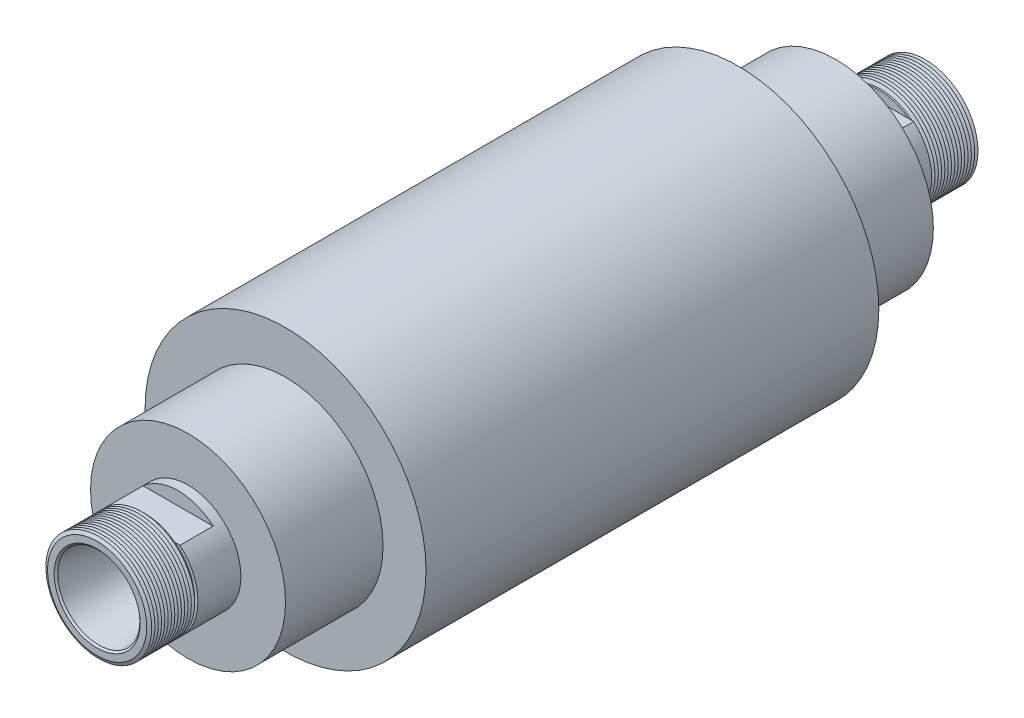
ISO-10303-21;
HEADER;
FILE_DESCRIPTION(('STEP AP214'),'2;1');
FILE_NAME('part.step','',(''),(''),'','','');
FILE_SCHEMA(('AUTOMOTIVE_DESIGN { 1 0 10303 214 1 1 1 1 }'));
ENDSEC;
DATA;
#1=APPLICATION_CONTEXT('core data for automotive mechanical design processes');
#2=APPLICATION_PROTOCOL_DEFINITION('international standard','automotive_design',2000,#1);
#3=PRODUCT_CONTEXT('',#1,'mechanical');
#4=PRODUCT('Part','Part','',(#3));
#5=PRODUCT_RELATED_PRODUCT_CATEGORY('part','',(#4));
#6=PRODUCT_DEFINITION_FORMATION('','',#4);
#7=PRODUCT_DEFINITION_CONTEXT('part definition',#1,'design');
#8=PRODUCT_DEFINITION('design','',#6,#7);
#9=PRODUCT_DEFINITION_SHAPE('','',#8);
#10=(LENGTH_UNIT() NAMED_UNIT(*) SI_UNIT(.MILLI.,.METRE.));
#11=(NAMED_UNIT(*) PLANE_ANGLE_UNIT() SI_UNIT($,.RADIAN.));
#12=(NAMED_UNIT(*) SI_UNIT($,.STERADIAN.) SOLID_ANGLE_UNIT());
#13=UNCERTAINTY_MEASURE_WITH_UNIT(LENGTH_MEASURE(1.E-05),#10,'distance_accuracy_value','');
#14=(GEOMETRIC_REPRESENTATION_CONTEXT(3) GLOBAL_UNCERTAINTY_ASSIGNED_CONTEXT((#13)) GLOBAL_UNIT_ASSIGNED_CONTEXT((#10,
#11,#12)) REPRESENTATION_CONTEXT('',''));
#15=CARTESIAN_POINT('',(0.,0.,0.));
#16=DIRECTION('',(0.,0.,1.));
#17=DIRECTION('',(1.,0.,0.));
#18=AXIS2_PLACEMENT_3D('',#15,#16,#17);
#19=CARTESIAN_POINT('',(0.,0.,1375.98236892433));
#20=DIRECTION('',(0.,0.,1.));
#21=DIRECTION('',(1.,0.,0.));
#22=AXIS2_PLACEMENT_3D('',#19,#20,#21);
#23=CYLINDRICAL_SURFACE('',#22,16.0000000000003);
#24=CARTESIAN_POINT('',(0.,0.,98.0000000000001));
#25=DIRECTION('',(0.,0.,1.));
#26=DIRECTION('',(1.,0.,0.));
#27=AXIS2_PLACEMENT_3D('',#24,#25,#26);
#28=CIRCLE('',#27,16.0000000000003);
#29=CARTESIAN_POINT('',(16.0000000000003,0.,98.0000000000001));
#30=VERTEX_POINT('',#29);
#31=EDGE_CURVE('E144',#30,#30,#28,.T.);
#32=ORIENTED_EDGE('',*,*,#31,.T.);
#33=EDGE_LOOP('',(#32));
#34=FACE_BOUND('',#33,.T.);
#35=DIRECTION('',(0.,0.,1.));
#36=VECTOR('',#35,1.);
#37=CARTESIAN_POINT('',(10.5830052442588,-12.,1375.98236892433));
#38=LINE('',#37,#36);
#39=CARTESIAN_POINT('',(10.5830052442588,-12.,101.));
#40=VERTEX_POINT('',#39);
#41=CARTESIAN_POINT('',(10.5830052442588,-12.,111.));
#42=VERTEX_POINT('',#41);
#43=EDGE_CURVE('E139',#40,#42,#38,.T.);
#44=ORIENTED_EDGE('',*,*,#43,.F.);
#45=CARTESIAN_POINT('',(0.,0.,101.));
#46=DIRECTION('',(0.,0.,-1.));
#47=DIRECTION('',(-1.,0.,0.));
#48=AXIS2_PLACEMENT_3D('',#45,#46,#47);
#49=CIRCLE('',#48,16.0000000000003);
#50=CARTESIAN_POINT('',(-10.5830052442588,-12.,101.));
#51=VERTEX_POINT('',#50);
#52=EDGE_CURVE('E11',#40,#51,#49,.T.);
#53=ORIENTED_EDGE('',*,*,#52,.T.);
#54=DIRECTION('',(0.,0.,1.));
#55=VECTOR('',#54,1.);
#56=CARTESIAN_POINT('',(-10.5830052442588,-12.,1375.98236892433));
#57=LINE('',#56,#55);
#58=CARTESIAN_POINT('',(-10.5830052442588,-12.,111.));
#59=VERTEX_POINT('',#58);
#60=EDGE_CURVE('E126',#59,#51,#57,.F.);
#61=ORIENTED_EDGE('',*,*,#60,.F.);
#62=CARTESIAN_POINT('',(0.,0.,111.));
#63=DIRECTION('',(0.,0.,1.));
#64=DIRECTION('',(1.,0.,0.));
#65=AXIS2_PLACEMENT_3D('',#62,#63,#64);
#66=CIRCLE('',#65,16.0000000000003);
#67=CARTESIAN_POINT('',(-10.5830052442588,12.,111.));
#68=VERTEX_POINT('',#67);
#69=EDGE_CURVE('E138',#68,#59,#66,.T.);
#70=ORIENTED_EDGE('',*,*,#69,.F.);
#71=DIRECTION('',(0.,0.,1.));
#72=VECTOR('',#71,1.);
#73=CARTESIAN_POINT('',(-10.5830052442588,12.,1375.98236892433));
#74=LINE('',#73,#72);
#75=CARTESIAN_POINT('',(-10.5830052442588,12.,101.));
#76=VERTEX_POINT('',#75);
#77=EDGE_CURVE('E200',#76,#68,#74,.T.);
#78=ORIENTED_EDGE('',*,*,#77,.F.);
#79=CARTESIAN_POINT('',(0.,0.,101.));
#80=DIRECTION('',(0.,0.,1.));
#81=DIRECTION('',(1.,0.,0.));
#82=AXIS2_PLACEMENT_3D('',#79,#80,#81);
#83=CIRCLE('',#82,16.0000000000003);
#84=CARTESIAN_POINT('',(10.5830052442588,12.,101.));
#85=VERTEX_POINT('',#84);
#86=EDGE_CURVE('E164',#85,#76,#83,.T.);
#87=ORIENTED_EDGE('',*,*,#86,.F.);
#88=DIRECTION('',(0.,0.,1.));
#89=VECTOR('',#88,1.);
#90=CARTESIAN_POINT('',(10.5830052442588,12.,1375.98236892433));
#91=LINE('',#90,#89);
#92=CARTESIAN_POINT('',(10.5830052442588,12.,111.));
#93=VERTEX_POINT('',#92);
#94=EDGE_CURVE('E198',#93,#85,#91,.F.);
#95=ORIENTED_EDGE('',*,*,#94,.F.);
#96=EDGE_CURVE('E145',#42,#93,#66,.T.);
#97=ORIENTED_EDGE('',*,*,#96,.F.);
#98=EDGE_LOOP('',(#44,#53,#61,#70,#78,#87,#95,#97));
#99=FACE_BOUND('',#98,.T.);
#100=ADVANCED_FACE('F34',(#34,#99),#23,.T.);
#101=CARTESIAN_POINT('',(0.,16.0000000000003,111.));
#102=DIRECTION('',(0.,0.,-1.));
#103=DIRECTION('',(-1.,0.,0.));
#104=AXIS2_PLACEMENT_3D('',#101,#102,#103);
#105=PLANE('',#104);
#106=DIRECTION('',(1.,0.,0.));
#107=VECTOR('',#106,1.);
#108=CARTESIAN_POINT('',(-36.4821613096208,-12.,111.));
#109=LINE('',#108,#107);
#110=CARTESIAN_POINT('',(9.00000000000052,-12.,111.));
#111=VERTEX_POINT('',#110);
#112=EDGE_CURVE('E133',#111,#42,#109,.T.);
#113=ORIENTED_EDGE('',*,*,#112,.T.);
#114=ORIENTED_EDGE('',*,*,#96,.T.);
#115=DIRECTION('',(1.,0.,0.));
#116=VECTOR('',#115,1.);
#117=CARTESIAN_POINT('',(-36.4821613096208,12.,111.));
#118=LINE('',#117,#116);
#119=CARTESIAN_POINT('',(9.00000000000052,12.,111.));
#120=VERTEX_POINT('',#119);
#121=EDGE_CURVE('E191',#120,#93,#118,.T.);
#122=ORIENTED_EDGE('',*,*,#121,.F.);
#123=CARTESIAN_POINT('',(0.,0.,111.));
#124=DIRECTION('',(0.,0.,1.));
#125=DIRECTION('',(1.,0.,0.));
#126=AXIS2_PLACEMENT_3D('',#123,#124,#125);
#127=CIRCLE('',#126,15.0000000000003);
#128=EDGE_CURVE('E429',#111,#120,#127,.T.);
#129=ORIENTED_EDGE('',*,*,#128,.F.);
#130=EDGE_LOOP('',(#113,#114,#122,#129));
#131=FACE_BOUND('',#130,.T.);
#132=ADVANCED_FACE('F450',(#131),#105,.F.);
#133=CARTESIAN_POINT('',(-9.00000000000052,-12.,111.));
#134=VERTEX_POINT('',#133);
#135=EDGE_CURVE('E122',#59,#134,#109,.T.);
#136=ORIENTED_EDGE('',*,*,#135,.T.);
#137=CARTESIAN_POINT('',(-9.00000000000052,12.,111.));
#138=VERTEX_POINT('',#137);
#139=EDGE_CURVE('E438',#138,#134,#127,.T.);
#140=ORIENTED_EDGE('',*,*,#139,.F.);
#141=EDGE_CURVE('E143',#68,#138,#118,.T.);
#142=ORIENTED_EDGE('',*,*,#141,.F.);
#143=ORIENTED_EDGE('',*,*,#69,.T.);
#144=EDGE_LOOP('',(#136,#140,#142,#143));
#145=FACE_BOUND('',#144,.T.);
#146=ADVANCED_FACE('F142',(#145),#105,.F.);
#147=CARTESIAN_POINT('',(0.,0.,-1375.98236892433));
#148=DIRECTION('',(0.,0.,-1.));
#149=DIRECTION('',(1.,0.,0.));
#150=AXIS2_PLACEMENT_3D('',#147,#148,#149);
#151=CYLINDRICAL_SURFACE('',#150,16.0000000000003);
#152=CARTESIAN_POINT('',(0.,0.,-98.0000000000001));
#153=DIRECTION('',(0.,0.,1.));
#154=DIRECTION('',(1.,0.,0.));
#155=AXIS2_PLACEMENT_3D('',#152,#153,#154);
#156=CIRCLE('',#155,16.0000000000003);
#157=CARTESIAN_POINT('',(16.0000000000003,0.,-98.0000000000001));
#158=VERTEX_POINT('',#157);
#159=EDGE_CURVE('E320',#158,#158,#156,.T.);
#160=ORIENTED_EDGE('',*,*,#159,.F.);
#161=EDGE_LOOP('',(#160));
#162=FACE_BOUND('',#161,.T.);
#163=DIRECTION('',(0.,0.,-1.));
#164=VECTOR('',#163,1.);
#165=CARTESIAN_POINT('',(-10.5830052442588,-12.,-1375.98236892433));
#166=LINE('',#165,#164);
#167=CARTESIAN_POINT('',(-10.5830052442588,-12.,-101.));
#168=VERTEX_POINT('',#167);
#169=CARTESIAN_POINT('',(-10.5830052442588,-12.,-111.));
#170=VERTEX_POINT('',#169);
#171=EDGE_CURVE('E173',#168,#170,#166,.T.);
#172=ORIENTED_EDGE('',*,*,#171,.F.);
#173=CARTESIAN_POINT('',(0.,0.,-101.));
#174=DIRECTION('',(0.,0.,1.));
#175=DIRECTION('',(1.,0.,0.));
#176=AXIS2_PLACEMENT_3D('',#173,#174,#175);
#177=CIRCLE('',#176,16.0000000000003);
#178=CARTESIAN_POINT('',(10.5830052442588,-12.,-101.));
#179=VERTEX_POINT('',#178);
#180=EDGE_CURVE('E42',#168,#179,#177,.T.);
#181=ORIENTED_EDGE('',*,*,#180,.T.);
#182=DIRECTION('',(0.,0.,-1.));
#183=VECTOR('',#182,1.);
#184=CARTESIAN_POINT('',(10.5830052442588,-12.,-1375.98236892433));
#185=LINE('',#184,#183);
#186=CARTESIAN_POINT('',(10.5830052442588,-12.,-111.));
#187=VERTEX_POINT('',#186);
#188=EDGE_CURVE('E170',#187,#179,#185,.F.);
#189=ORIENTED_EDGE('',*,*,#188,.F.);
#190=CARTESIAN_POINT('',(0.,0.,-111.));
#191=DIRECTION('',(0.,0.,1.));
#192=DIRECTION('',(1.,0.,0.));
#193=AXIS2_PLACEMENT_3D('',#190,#191,#192);
#194=CIRCLE('',#193,16.0000000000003);
#195=CARTESIAN_POINT('',(10.5830052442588,12.,-111.));
#196=VERTEX_POINT('',#195);
#197=EDGE_CURVE('E316',#187,#196,#194,.T.);
#198=ORIENTED_EDGE('',*,*,#197,.T.);
#199=DIRECTION('',(0.,0.,-1.));
#200=VECTOR('',#199,1.);
#201=CARTESIAN_POINT('',(10.5830052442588,12.,-1375.98236892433));
#202=LINE('',#201,#200);
#203=CARTESIAN_POINT('',(10.5830052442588,12.,-101.));
#204=VERTEX_POINT('',#203);
#205=EDGE_CURVE('E211',#204,#196,#202,.T.);
#206=ORIENTED_EDGE('',*,*,#205,.F.);
#207=CARTESIAN_POINT('',(0.,0.,-101.));
#208=DIRECTION('',(0.,0.,-1.));
#209=DIRECTION('',(-1.,0.,0.));
#210=AXIS2_PLACEMENT_3D('',#207,#208,#209);
#211=CIRCLE('',#210,16.0000000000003);
#212=CARTESIAN_POINT('',(-10.5830052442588,12.,-101.));
#213=VERTEX_POINT('',#212);
#214=EDGE_CURVE('E162',#213,#204,#211,.T.);
#215=ORIENTED_EDGE('',*,*,#214,.F.);
#216=DIRECTION('',(0.,0.,-1.));
#217=VECTOR('',#216,1.);
#218=CARTESIAN_POINT('',(-10.5830052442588,12.,-1375.98236892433));
#219=LINE('',#218,#217);
#220=CARTESIAN_POINT('',(-10.5830052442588,12.,-111.));
#221=VERTEX_POINT('',#220);
#222=EDGE_CURVE('E209',#221,#213,#219,.F.);
#223=ORIENTED_EDGE('',*,*,#222,.F.);
#224=EDGE_CURVE('E318',#221,#170,#194,.T.);
#225=ORIENTED_EDGE('',*,*,#224,.T.);
#226=EDGE_LOOP('',(#172,#181,#189,#198,#206,#215,#223,#225));
#227=FACE_BOUND('',#226,.T.);
#228=ADVANCED_FACE('F169',(#162,#227),#151,.T.);
#229=CARTESIAN_POINT('',(0.,16.0000000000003,-111.));
#230=DIRECTION('',(0.,0.,1.));
#231=DIRECTION('',(-1.,0.,0.));
#232=AXIS2_PLACEMENT_3D('',#229,#230,#231);
#233=PLANE('',#232);
#234=DIRECTION('',(-1.,0.,0.));
#235=VECTOR('',#234,1.);
#236=CARTESIAN_POINT('',(-36.4821613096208,-12.,-111.));
#237=LINE('',#236,#235);
#238=CARTESIAN_POINT('',(-9.00000000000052,-12.,-111.));
#239=VERTEX_POINT('',#238);
#240=EDGE_CURVE('E187',#239,#170,#237,.T.);
#241=ORIENTED_EDGE('',*,*,#240,.T.);
#242=ORIENTED_EDGE('',*,*,#224,.F.);
#243=DIRECTION('',(-1.,0.,0.));
#244=VECTOR('',#243,1.);
#245=CARTESIAN_POINT('',(-36.4821613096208,12.,-111.));
#246=LINE('',#245,#244);
#247=CARTESIAN_POINT('',(-9.00000000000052,12.,-111.));
#248=VERTEX_POINT('',#247);
#249=EDGE_CURVE('E205',#248,#221,#246,.T.);
#250=ORIENTED_EDGE('',*,*,#249,.F.);
#251=CARTESIAN_POINT('',(0.,0.,-111.));
#252=DIRECTION('',(0.,0.,1.));
#253=DIRECTION('',(1.,0.,0.));
#254=AXIS2_PLACEMENT_3D('',#251,#252,#253);
#255=CIRCLE('',#254,15.0000000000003);
#256=EDGE_CURVE('E317',#248,#239,#255,.T.);
#257=ORIENTED_EDGE('',*,*,#256,.T.);
#258=EDGE_LOOP('',(#241,#242,#250,#257));
#259=FACE_BOUND('',#258,.T.);
#260=ADVANCED_FACE('F1264',(#259),#233,.F.);
#261=CARTESIAN_POINT('',(9.00000000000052,-12.,-111.));
#262=VERTEX_POINT('',#261);
#263=EDGE_CURVE('E182',#187,#262,#237,.T.);
#264=ORIENTED_EDGE('',*,*,#263,.T.);
#265=CARTESIAN_POINT('',(9.00000000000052,12.,-111.));
#266=VERTEX_POINT('',#265);
#267=EDGE_CURVE('E313',#262,#266,#255,.T.);
#268=ORIENTED_EDGE('',*,*,#267,.T.);
#269=EDGE_CURVE('E208',#196,#266,#246,.T.);
#270=ORIENTED_EDGE('',*,*,#269,.F.);
#271=ORIENTED_EDGE('',*,*,#197,.F.);
#272=EDGE_LOOP('',(#264,#268,#270,#271));
#273=FACE_BOUND('',#272,.T.);
#274=ADVANCED_FACE('F473',(#273),#233,.F.);
#275=CARTESIAN_POINT('',(0.,0.,1375.98236892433));
#276=DIRECTION('',(0.,0.,1.));
#277=DIRECTION('',(1.,0.,0.));
#278=AXIS2_PLACEMENT_3D('',#275,#276,#277);
#279=CYLINDRICAL_SURFACE('',#278,42.5);
#280=CARTESIAN_POINT('',(0.,0.,68.5));
#281=DIRECTION('',(0.,0.,1.));
#282=DIRECTION('',(1.,0.,0.));
#283=AXIS2_PLACEMENT_3D('',#280,#281,#282);
#284=CIRCLE('',#283,42.5);
#285=CARTESIAN_POINT('',(42.5,0.,68.5));
#286=VERTEX_POINT('',#285);
#287=EDGE_CURVE('E159',#286,#286,#284,.T.);
#288=ORIENTED_EDGE('',*,*,#287,.F.);
#289=EDGE_LOOP('',(#288));
#290=FACE_BOUND('',#289,.T.);
#291=CARTESIAN_POINT('',(0.,0.,-68.5));
#292=DIRECTION('',(0.,0.,1.));
#293=DIRECTION('',(1.,0.,0.));
#294=AXIS2_PLACEMENT_3D('',#291,#292,#293);
#295=CIRCLE('',#294,42.5);
#296=CARTESIAN_POINT('',(42.5,0.,-68.5));
#297=VERTEX_POINT('',#296);
#298=EDGE_CURVE('E329',#297,#297,#295,.T.);
#299=ORIENTED_EDGE('',*,*,#298,.T.);
#300=EDGE_LOOP('',(#299));
#301=FACE_BOUND('',#300,.T.);
#302=ADVANCED_FACE('F36',(#290,#301),#279,.T.);
#303=CARTESIAN_POINT('',(0.,42.5,68.5));
#304=DIRECTION('',(0.,0.,-1.));
#305=DIRECTION('',(-1.,0.,0.));
#306=AXIS2_PLACEMENT_3D('',#303,#304,#305);
#307=PLANE('',#306);
#308=CARTESIAN_POINT('',(0.,0.,68.5));
#309=DIRECTION('',(0.,0.,1.));
#310=DIRECTION('',(1.,0.,0.));
#311=AXIS2_PLACEMENT_3D('',#308,#309,#310);
#312=CIRCLE('',#311,29.5);
#313=CARTESIAN_POINT('',(29.5,0.,68.5));
#314=VERTEX_POINT('',#313);
#315=EDGE_CURVE('E156',#314,#314,#312,.T.);
#316=ORIENTED_EDGE('',*,*,#315,.F.);
#317=EDGE_LOOP('',(#316));
#318=FACE_BOUND('',#317,.T.);
#319=ORIENTED_EDGE('',*,*,#287,.T.);
#320=EDGE_LOOP('',(#319));
#321=FACE_BOUND('',#320,.T.);
#322=ADVANCED_FACE('F466',(#318,#321),#307,.F.);
#323=CARTESIAN_POINT('',(0.,0.,1375.98236892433));
#324=DIRECTION('',(0.,0.,1.));
#325=DIRECTION('',(1.,0.,0.));
#326=AXIS2_PLACEMENT_3D('',#323,#324,#325);
#327=CYLINDRICAL_SURFACE('',#326,29.5);
#328=CARTESIAN_POINT('',(0.,0.,98.0000000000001));
#329=DIRECTION('',(0.,0.,1.));
#330=DIRECTION('',(1.,0.,0.));
#331=AXIS2_PLACEMENT_3D('',#328,#329,#330);
#332=CIRCLE('',#331,29.5);
#333=CARTESIAN_POINT('',(29.5,0.,98.0000000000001));
#334=VERTEX_POINT('',#333);
#335=EDGE_CURVE('E148',#334,#334,#332,.T.);
#336=ORIENTED_EDGE('',*,*,#335,.F.);
#337=EDGE_LOOP('',(#336));
#338=FACE_BOUND('',#337,.T.);
#339=ORIENTED_EDGE('',*,*,#315,.T.);
#340=EDGE_LOOP('',(#339));
#341=FACE_BOUND('',#340,.T.);
#342=ADVANCED_FACE('F463',(#338,#341),#327,.T.);
#343=CARTESIAN_POINT('',(0.,29.5,98.));
#344=DIRECTION('',(0.,0.,-1.));
#345=DIRECTION('',(-1.,0.,0.));
#346=AXIS2_PLACEMENT_3D('',#343,#344,#345);
#347=PLANE('',#346);
#348=ORIENTED_EDGE('',*,*,#31,.F.);
#349=EDGE_LOOP('',(#348));
#350=FACE_BOUND('',#349,.T.);
#351=ORIENTED_EDGE('',*,*,#335,.T.);
#352=EDGE_LOOP('',(#351));
#353=FACE_BOUND('',#352,.T.);
#354=ADVANCED_FACE('F460',(#350,#353),#347,.F.);
#355=CARTESIAN_POINT('',(0.,0.,1375.98236892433));
#356=DIRECTION('',(0.,0.,1.));
#357=DIRECTION('',(1.,0.,0.));
#358=AXIS2_PLACEMENT_3D('',#355,#356,#357);
#359=CYLINDRICAL_SURFACE('',#358,15.0000000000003);
#360=CARTESIAN_POINT('',(0.,0.,111.5));
#361=DIRECTION('',(0.,0.,1.));
#362=DIRECTION('',(1.,0.,0.));
#363=AXIS2_PLACEMENT_3D('',#360,#361,#362);
#364=CIRCLE('',#363,15.0000000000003);
#365=CARTESIAN_POINT('',(15.0000000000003,0.,111.5));
#366=VERTEX_POINT('',#365);
#367=EDGE_CURVE('E427',#366,#366,#364,.T.);
#368=ORIENTED_EDGE('',*,*,#367,.F.);
#369=EDGE_LOOP('',(#368));
#370=FACE_BOUND('',#369,.T.);
#371=EDGE_CURVE('E150',#120,#138,#127,.T.);
#372=ORIENTED_EDGE('',*,*,#371,.T.);
#373=ORIENTED_EDGE('',*,*,#139,.T.);
#374=EDGE_CURVE('E432',#134,#111,#127,.T.);
#375=ORIENTED_EDGE('',*,*,#374,.T.);
#376=ORIENTED_EDGE('',*,*,#128,.T.);
#377=EDGE_LOOP('',(#372,#373,#375,#376));
#378=FACE_BOUND('',#377,.T.);
#379=ADVANCED_FACE('F439',(#370,#378),#359,.T.);
#380=CARTESIAN_POINT('',(0.,0.,111.5));
#381=DIRECTION('',(0.,0.,1.));
#382=DIRECTION('',(1.,0.,0.));
#383=AXIS2_PLACEMENT_3D('',#380,#381,#382);
#384=CONICAL_SURFACE('',#383,15.0000000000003,1.10714871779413);
#385=CARTESIAN_POINT('',(0.,0.,112.));
#386=DIRECTION('',(0.,0.,1.));
#387=DIRECTION('',(1.,0.,0.));
#388=AXIS2_PLACEMENT_3D('',#385,#386,#387);
#389=CIRCLE('',#388,16.0000000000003);
#390=CARTESIAN_POINT('',(16.0000000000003,0.,112.));
#391=VERTEX_POINT('',#390);
#392=EDGE_CURVE('E425',#391,#391,#389,.T.);
#393=ORIENTED_EDGE('',*,*,#392,.F.);
#394=EDGE_LOOP('',(#393));
#395=FACE_BOUND('',#394,.T.);
#396=ORIENTED_EDGE('',*,*,#367,.T.);
#397=EDGE_LOOP('',(#396));
#398=FACE_BOUND('',#397,.T.);
#399=ADVANCED_FACE('F621',(#395,#398),#384,.T.);
#400=CARTESIAN_POINT('',(0.,0.,112.));
#401=DIRECTION('',(0.,0.,-1.));
#402=DIRECTION('',(-1.,0.,0.));
#403=AXIS2_PLACEMENT_3D('',#400,#401,#402);
#404=CONICAL_SURFACE('',#403,16.0000000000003,1.10714871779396);
#405=CARTESIAN_POINT('',(0.,0.,112.5));
#406=DIRECTION('',(0.,0.,1.));
#407=DIRECTION('',(1.,0.,0.));
#408=AXIS2_PLACEMENT_3D('',#405,#406,#407);
#409=CIRCLE('',#408,15.0000000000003);
#410=CARTESIAN_POINT('',(15.0000000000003,0.,112.5));
#411=VERTEX_POINT('',#410);
#412=EDGE_CURVE('E422',#411,#411,#409,.T.);
#413=ORIENTED_EDGE('',*,*,#412,.F.);
#414=EDGE_LOOP('',(#413));
#415=FACE_BOUND('',#414,.T.);
#416=ORIENTED_EDGE('',*,*,#392,.T.);
#417=EDGE_LOOP('',(#416));
#418=FACE_BOUND('',#417,.T.);
#419=ADVANCED_FACE('F617',(#415,#418),#404,.T.);
#420=CARTESIAN_POINT('',(0.,0.,112.5));
#421=DIRECTION('',(0.,0.,1.));
#422=DIRECTION('',(1.,0.,0.));
#423=AXIS2_PLACEMENT_3D('',#420,#421,#422);
#424=CONICAL_SURFACE('',#423,15.0000000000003,1.10714871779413);
#425=CARTESIAN_POINT('',(0.,0.,113.));
#426=DIRECTION('',(0.,0.,1.));
#427=DIRECTION('',(1.,0.,0.));
#428=AXIS2_PLACEMENT_3D('',#425,#426,#427);
#429=CIRCLE('',#428,16.0000000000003);
#430=CARTESIAN_POINT('',(16.0000000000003,0.,113.));
#431=VERTEX_POINT('',#430);
#432=EDGE_CURVE('E419',#431,#431,#429,.T.);
#433=ORIENTED_EDGE('',*,*,#432,.F.);
#434=EDGE_LOOP('',(#433));
#435=FACE_BOUND('',#434,.T.);
#436=ORIENTED_EDGE('',*,*,#412,.T.);
#437=EDGE_LOOP('',(#436));
#438=FACE_BOUND('',#437,.T.);
#439=ADVANCED_FACE('F613',(#435,#438),#424,.T.);
#440=CARTESIAN_POINT('',(0.,0.,113.));
#441=DIRECTION('',(0.,0.,-1.));
#442=DIRECTION('',(-1.,0.,0.));
#443=AXIS2_PLACEMENT_3D('',#440,#441,#442);
#444=CONICAL_SURFACE('',#443,16.0000000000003,1.10714871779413);
#445=CARTESIAN_POINT('',(0.,0.,113.5));
#446=DIRECTION('',(0.,0.,1.));
#447=DIRECTION('',(1.,0.,0.));
#448=AXIS2_PLACEMENT_3D('',#445,#446,#447);
#449=CIRCLE('',#448,15.0000000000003);
#450=CARTESIAN_POINT('',(15.0000000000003,0.,113.5));
#451=VERTEX_POINT('',#450);
#452=EDGE_CURVE('E416',#451,#451,#449,.T.);
#453=ORIENTED_EDGE('',*,*,#452,.F.);
#454=EDGE_LOOP('',(#453));
#455=FACE_BOUND('',#454,.T.);
#456=ORIENTED_EDGE('',*,*,#432,.T.);
#457=EDGE_LOOP('',(#456));
#458=FACE_BOUND('',#457,.T.);
#459=ADVANCED_FACE('F609',(#455,#458),#444,.T.);
#460=CARTESIAN_POINT('',(0.,0.,113.5));
#461=DIRECTION('',(0.,0.,1.));
#462=DIRECTION('',(1.,0.,0.));
#463=AXIS2_PLACEMENT_3D('',#460,#461,#462);
#464=CONICAL_SURFACE('',#463,15.0000000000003,1.10714871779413);
#465=CARTESIAN_POINT('',(0.,0.,114.));
#466=DIRECTION('',(0.,0.,1.));
#467=DIRECTION('',(1.,0.,0.));
#468=AXIS2_PLACEMENT_3D('',#465,#466,#467);
#469=CIRCLE('',#468,16.0000000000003);
#470=CARTESIAN_POINT('',(16.0000000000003,0.,114.));
#471=VERTEX_POINT('',#470);
#472=EDGE_CURVE('E413',#471,#471,#469,.T.);
#473=ORIENTED_EDGE('',*,*,#472,.F.);
#474=EDGE_LOOP('',(#473));
#475=FACE_BOUND('',#474,.T.);
#476=ORIENTED_EDGE('',*,*,#452,.T.);
#477=EDGE_LOOP('',(#476));
#478=FACE_BOUND('',#477,.T.);
#479=ADVANCED_FACE('F605',(#475,#478),#464,.T.);
#480=CARTESIAN_POINT('',(0.,0.,114.));
#481=DIRECTION('',(0.,0.,-1.));
#482=DIRECTION('',(-1.,0.,0.));
#483=AXIS2_PLACEMENT_3D('',#480,#481,#482);
#484=CONICAL_SURFACE('',#483,16.0000000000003,1.10714871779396);
#485=CARTESIAN_POINT('',(0.,0.,114.5));
#486=DIRECTION('',(0.,0.,1.));
#487=DIRECTION('',(1.,0.,0.));
#488=AXIS2_PLACEMENT_3D('',#485,#486,#487);
#489=CIRCLE('',#488,15.0000000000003);
#490=CARTESIAN_POINT('',(15.0000000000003,0.,114.5));
#491=VERTEX_POINT('',#490);
#492=EDGE_CURVE('E410',#491,#491,#489,.T.);
#493=ORIENTED_EDGE('',*,*,#492,.F.);
#494=EDGE_LOOP('',(#493));
#495=FACE_BOUND('',#494,.T.);
#496=ORIENTED_EDGE('',*,*,#472,.T.);
#497=EDGE_LOOP('',(#496));
#498=FACE_BOUND('',#497,.T.);
#499=ADVANCED_FACE('F601',(#495,#498),#484,.T.);
#500=CARTESIAN_POINT('',(0.,0.,114.5));
#501=DIRECTION('',(0.,0.,1.));
#502=DIRECTION('',(1.,0.,0.));
#503=AXIS2_PLACEMENT_3D('',#500,#501,#502);
#504=CONICAL_SURFACE('',#503,15.0000000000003,1.10714871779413);
#505=CARTESIAN_POINT('',(0.,0.,115.));
#506=DIRECTION('',(0.,0.,1.));
#507=DIRECTION('',(1.,0.,0.));
#508=AXIS2_PLACEMENT_3D('',#505,#506,#507);
#509=CIRCLE('',#508,16.0000000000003);
#510=CARTESIAN_POINT('',(16.0000000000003,0.,115.));
#511=VERTEX_POINT('',#510);
#512=EDGE_CURVE('E407',#511,#511,#509,.T.);
#513=ORIENTED_EDGE('',*,*,#512,.F.);
#514=EDGE_LOOP('',(#513));
#515=FACE_BOUND('',#514,.T.);
#516=ORIENTED_EDGE('',*,*,#492,.T.);
#517=EDGE_LOOP('',(#516));
#518=FACE_BOUND('',#517,.T.);
#519=ADVANCED_FACE('F597',(#515,#518),#504,.T.);
#520=CARTESIAN_POINT('',(0.,0.,115.));
#521=DIRECTION('',(0.,0.,-1.));
#522=DIRECTION('',(-1.,0.,0.));
#523=AXIS2_PLACEMENT_3D('',#520,#521,#522);
#524=CONICAL_SURFACE('',#523,16.0000000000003,1.10714871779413);
#525=CARTESIAN_POINT('',(0.,0.,115.5));
#526=DIRECTION('',(0.,0.,1.));
#527=DIRECTION('',(1.,0.,0.));
#528=AXIS2_PLACEMENT_3D('',#525,#526,#527);
#529=CIRCLE('',#528,15.0000000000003);
#530=CARTESIAN_POINT('',(15.0000000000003,0.,115.5));
#531=VERTEX_POINT('',#530);
#532=EDGE_CURVE('E404',#531,#531,#529,.T.);
#533=ORIENTED_EDGE('',*,*,#532,.F.);
#534=EDGE_LOOP('',(#533));
#535=FACE_BOUND('',#534,.T.);
#536=ORIENTED_EDGE('',*,*,#512,.T.);
#537=EDGE_LOOP('',(#536));
#538=FACE_BOUND('',#537,.T.);
#539=ADVANCED_FACE('F593',(#535,#538),#524,.T.);
#540=CARTESIAN_POINT('',(0.,0.,115.5));
#541=DIRECTION('',(0.,0.,1.));
#542=DIRECTION('',(1.,0.,0.));
#543=AXIS2_PLACEMENT_3D('',#540,#541,#542);
#544=CONICAL_SURFACE('',#543,15.0000000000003,1.10714871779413);
#545=CARTESIAN_POINT('',(0.,0.,116.));
#546=DIRECTION('',(0.,0.,1.));
#547=DIRECTION('',(1.,0.,0.));
#548=AXIS2_PLACEMENT_3D('',#545,#546,#547);
#549=CIRCLE('',#548,16.0000000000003);
#550=CARTESIAN_POINT('',(16.0000000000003,0.,116.));
#551=VERTEX_POINT('',#550);
#552=EDGE_CURVE('E401',#551,#551,#549,.T.);
#553=ORIENTED_EDGE('',*,*,#552,.F.);
#554=EDGE_LOOP('',(#553));
#555=FACE_BOUND('',#554,.T.);
#556=ORIENTED_EDGE('',*,*,#532,.T.);
#557=EDGE_LOOP('',(#556));
#558=FACE_BOUND('',#557,.T.);
#559=ADVANCED_FACE('F589',(#555,#558),#544,.T.);
#560=CARTESIAN_POINT('',(0.,0.,116.));
#561=DIRECTION('',(0.,0.,-1.));
#562=DIRECTION('',(-1.,0.,0.));
#563=AXIS2_PLACEMENT_3D('',#560,#561,#562);
#564=CONICAL_SURFACE('',#563,16.0000000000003,1.10714871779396);
#565=CARTESIAN_POINT('',(0.,0.,116.5));
#566=DIRECTION('',(0.,0.,1.));
#567=DIRECTION('',(1.,0.,0.));
#568=AXIS2_PLACEMENT_3D('',#565,#566,#567);
#569=CIRCLE('',#568,15.0000000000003);
#570=CARTESIAN_POINT('',(15.0000000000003,0.,116.5));
#571=VERTEX_POINT('',#570);
#572=EDGE_CURVE('E398',#571,#571,#569,.T.);
#573=ORIENTED_EDGE('',*,*,#572,.F.);
#574=EDGE_LOOP('',(#573));
#575=FACE_BOUND('',#574,.T.);
#576=ORIENTED_EDGE('',*,*,#552,.T.);
#577=EDGE_LOOP('',(#576));
#578=FACE_BOUND('',#577,.T.);
#579=ADVANCED_FACE('F585',(#575,#578),#564,.T.);
#580=CARTESIAN_POINT('',(0.,0.,116.5));
#581=DIRECTION('',(0.,0.,1.));
#582=DIRECTION('',(1.,0.,0.));
#583=AXIS2_PLACEMENT_3D('',#580,#581,#582);
#584=CONICAL_SURFACE('',#583,15.0000000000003,1.10714871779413);
#585=CARTESIAN_POINT('',(0.,0.,117.));
#586=DIRECTION('',(0.,0.,1.));
#587=DIRECTION('',(1.,0.,0.));
#588=AXIS2_PLACEMENT_3D('',#585,#586,#587);
#589=CIRCLE('',#588,16.0000000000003);
#590=CARTESIAN_POINT('',(16.0000000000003,0.,117.));
#591=VERTEX_POINT('',#590);
#592=EDGE_CURVE('E395',#591,#591,#589,.T.);
#593=ORIENTED_EDGE('',*,*,#592,.F.);
#594=EDGE_LOOP('',(#593));
#595=FACE_BOUND('',#594,.T.);
#596=ORIENTED_EDGE('',*,*,#572,.T.);
#597=EDGE_LOOP('',(#596));
#598=FACE_BOUND('',#597,.T.);
#599=ADVANCED_FACE('F581',(#595,#598),#584,.T.);
#600=CARTESIAN_POINT('',(0.,0.,117.));
#601=DIRECTION('',(0.,0.,-1.));
#602=DIRECTION('',(-1.,0.,0.));
#603=AXIS2_PLACEMENT_3D('',#600,#601,#602);
#604=CONICAL_SURFACE('',#603,16.0000000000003,1.10714871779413);
#605=CARTESIAN_POINT('',(0.,0.,117.5));
#606=DIRECTION('',(0.,0.,1.));
#607=DIRECTION('',(1.,0.,0.));
#608=AXIS2_PLACEMENT_3D('',#605,#606,#607);
#609=CIRCLE('',#608,15.0000000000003);
#610=CARTESIAN_POINT('',(15.0000000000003,0.,117.5));
#611=VERTEX_POINT('',#610);
#612=EDGE_CURVE('E392',#611,#611,#609,.T.);
#613=ORIENTED_EDGE('',*,*,#612,.F.);
#614=EDGE_LOOP('',(#613));
#615=FACE_BOUND('',#614,.T.);
#616=ORIENTED_EDGE('',*,*,#592,.T.);
#617=EDGE_LOOP('',(#616));
#618=FACE_BOUND('',#617,.T.);
#619=ADVANCED_FACE('F577',(#615,#618),#604,.T.);
#620=CARTESIAN_POINT('',(0.,0.,117.5));
#621=DIRECTION('',(0.,0.,1.));
#622=DIRECTION('',(1.,0.,0.));
#623=AXIS2_PLACEMENT_3D('',#620,#621,#622);
#624=CONICAL_SURFACE('',#623,15.0000000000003,1.10714871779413);
#625=CARTESIAN_POINT('',(0.,0.,118.));
#626=DIRECTION('',(0.,0.,1.));
#627=DIRECTION('',(1.,0.,0.));
#628=AXIS2_PLACEMENT_3D('',#625,#626,#627);
#629=CIRCLE('',#628,16.0000000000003);
#630=CARTESIAN_POINT('',(16.0000000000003,0.,118.));
#631=VERTEX_POINT('',#630);
#632=EDGE_CURVE('E389',#631,#631,#629,.T.);
#633=ORIENTED_EDGE('',*,*,#632,.F.);
#634=EDGE_LOOP('',(#633));
#635=FACE_BOUND('',#634,.T.);
#636=ORIENTED_EDGE('',*,*,#612,.T.);
#637=EDGE_LOOP('',(#636));
#638=FACE_BOUND('',#637,.T.);
#639=ADVANCED_FACE('F573',(#635,#638),#624,.T.);
#640=CARTESIAN_POINT('',(0.,0.,118.));
#641=DIRECTION('',(0.,0.,-1.));
#642=DIRECTION('',(-1.,0.,0.));
#643=AXIS2_PLACEMENT_3D('',#640,#641,#642);
#644=CONICAL_SURFACE('',#643,16.0000000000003,1.10714871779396);
#645=CARTESIAN_POINT('',(0.,0.,118.5));
#646=DIRECTION('',(0.,0.,1.));
#647=DIRECTION('',(1.,0.,0.));
#648=AXIS2_PLACEMENT_3D('',#645,#646,#647);
#649=CIRCLE('',#648,15.0000000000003);
#650=CARTESIAN_POINT('',(15.0000000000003,0.,118.5));
#651=VERTEX_POINT('',#650);
#652=EDGE_CURVE('E386',#651,#651,#649,.T.);
#653=ORIENTED_EDGE('',*,*,#652,.F.);
#654=EDGE_LOOP('',(#653));
#655=FACE_BOUND('',#654,.T.);
#656=ORIENTED_EDGE('',*,*,#632,.T.);
#657=EDGE_LOOP('',(#656));
#658=FACE_BOUND('',#657,.T.);
#659=ADVANCED_FACE('F569',(#655,#658),#644,.T.);
#660=CARTESIAN_POINT('',(0.,0.,118.5));
#661=DIRECTION('',(0.,0.,1.));
#662=DIRECTION('',(1.,0.,0.));
#663=AXIS2_PLACEMENT_3D('',#660,#661,#662);
#664=CONICAL_SURFACE('',#663,15.0000000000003,1.10714871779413);
#665=CARTESIAN_POINT('',(0.,0.,119.));
#666=DIRECTION('',(0.,0.,1.));
#667=DIRECTION('',(1.,0.,0.));
#668=AXIS2_PLACEMENT_3D('',#665,#666,#667);
#669=CIRCLE('',#668,16.0000000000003);
#670=CARTESIAN_POINT('',(16.0000000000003,0.,119.));
#671=VERTEX_POINT('',#670);
#672=EDGE_CURVE('E383',#671,#671,#669,.T.);
#673=ORIENTED_EDGE('',*,*,#672,.F.);
#674=EDGE_LOOP('',(#673));
#675=FACE_BOUND('',#674,.T.);
#676=ORIENTED_EDGE('',*,*,#652,.T.);
#677=EDGE_LOOP('',(#676));
#678=FACE_BOUND('',#677,.T.);
#679=ADVANCED_FACE('F565',(#675,#678),#664,.T.);
#680=CARTESIAN_POINT('',(0.,0.,119.));
#681=DIRECTION('',(0.,0.,-1.));
#682=DIRECTION('',(-1.,0.,0.));
#683=AXIS2_PLACEMENT_3D('',#680,#681,#682);
#684=CONICAL_SURFACE('',#683,16.0000000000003,1.10714871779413);
#685=CARTESIAN_POINT('',(0.,0.,119.5));
#686=DIRECTION('',(0.,0.,1.));
#687=DIRECTION('',(1.,0.,0.));
#688=AXIS2_PLACEMENT_3D('',#685,#686,#687);
#689=CIRCLE('',#688,15.0000000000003);
#690=CARTESIAN_POINT('',(15.0000000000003,0.,119.5));
#691=VERTEX_POINT('',#690);
#692=EDGE_CURVE('E380',#691,#691,#689,.T.);
#693=ORIENTED_EDGE('',*,*,#692,.F.);
#694=EDGE_LOOP('',(#693));
#695=FACE_BOUND('',#694,.T.);
#696=ORIENTED_EDGE('',*,*,#672,.T.);
#697=EDGE_LOOP('',(#696));
#698=FACE_BOUND('',#697,.T.);
#699=ADVANCED_FACE('F561',(#695,#698),#684,.T.);
#700=CARTESIAN_POINT('',(0.,0.,119.5));
#701=DIRECTION('',(0.,0.,1.));
#702=DIRECTION('',(1.,0.,0.));
#703=AXIS2_PLACEMENT_3D('',#700,#701,#702);
#704=CONICAL_SURFACE('',#703,15.0000000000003,1.10714871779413);
#705=CARTESIAN_POINT('',(0.,0.,120.));
#706=DIRECTION('',(0.,0.,1.));
#707=DIRECTION('',(1.,0.,0.));
#708=AXIS2_PLACEMENT_3D('',#705,#706,#707);
#709=CIRCLE('',#708,16.0000000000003);
#710=CARTESIAN_POINT('',(16.0000000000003,0.,120.));
#711=VERTEX_POINT('',#710);
#712=EDGE_CURVE('E377',#711,#711,#709,.T.);
#713=ORIENTED_EDGE('',*,*,#712,.F.);
#714=EDGE_LOOP('',(#713));
#715=FACE_BOUND('',#714,.T.);
#716=ORIENTED_EDGE('',*,*,#692,.T.);
#717=EDGE_LOOP('',(#716));
#718=FACE_BOUND('',#717,.T.);
#719=ADVANCED_FACE('F557',(#715,#718),#704,.T.);
#720=CARTESIAN_POINT('',(0.,0.,120.));
#721=DIRECTION('',(0.,0.,-1.));
#722=DIRECTION('',(-1.,0.,0.));
#723=AXIS2_PLACEMENT_3D('',#720,#721,#722);
#724=CONICAL_SURFACE('',#723,16.0000000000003,1.10714871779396);
#725=CARTESIAN_POINT('',(0.,0.,120.5));
#726=DIRECTION('',(0.,0.,1.));
#727=DIRECTION('',(1.,0.,0.));
#728=AXIS2_PLACEMENT_3D('',#725,#726,#727);
#729=CIRCLE('',#728,15.0000000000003);
#730=CARTESIAN_POINT('',(15.0000000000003,0.,120.5));
#731=VERTEX_POINT('',#730);
#732=EDGE_CURVE('E374',#731,#731,#729,.T.);
#733=ORIENTED_EDGE('',*,*,#732,.F.);
#734=EDGE_LOOP('',(#733));
#735=FACE_BOUND('',#734,.T.);
#736=ORIENTED_EDGE('',*,*,#712,.T.);
#737=EDGE_LOOP('',(#736));
#738=FACE_BOUND('',#737,.T.);
#739=ADVANCED_FACE('F553',(#735,#738),#724,.T.);
#740=CARTESIAN_POINT('',(0.,0.,120.5));
#741=DIRECTION('',(0.,0.,1.));
#742=DIRECTION('',(1.,0.,0.));
#743=AXIS2_PLACEMENT_3D('',#740,#741,#742);
#744=CONICAL_SURFACE('',#743,15.0000000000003,1.10714871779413);
#745=CARTESIAN_POINT('',(0.,0.,121.));
#746=DIRECTION('',(0.,0.,1.));
#747=DIRECTION('',(1.,0.,0.));
#748=AXIS2_PLACEMENT_3D('',#745,#746,#747);
#749=CIRCLE('',#748,16.0000000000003);
#750=CARTESIAN_POINT('',(16.0000000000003,0.,121.));
#751=VERTEX_POINT('',#750);
#752=EDGE_CURVE('E371',#751,#751,#749,.T.);
#753=ORIENTED_EDGE('',*,*,#752,.F.);
#754=EDGE_LOOP('',(#753));
#755=FACE_BOUND('',#754,.T.);
#756=ORIENTED_EDGE('',*,*,#732,.T.);
#757=EDGE_LOOP('',(#756));
#758=FACE_BOUND('',#757,.T.);
#759=ADVANCED_FACE('F549',(#755,#758),#744,.T.);
#760=CARTESIAN_POINT('',(0.,0.,121.));
#761=DIRECTION('',(0.,0.,-1.));
#762=DIRECTION('',(-1.,0.,0.));
#763=AXIS2_PLACEMENT_3D('',#760,#761,#762);
#764=CONICAL_SURFACE('',#763,16.0000000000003,1.10714871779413);
#765=CARTESIAN_POINT('',(0.,0.,121.5));
#766=DIRECTION('',(0.,0.,1.));
#767=DIRECTION('',(1.,0.,0.));
#768=AXIS2_PLACEMENT_3D('',#765,#766,#767);
#769=CIRCLE('',#768,15.0000000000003);
#770=CARTESIAN_POINT('',(15.0000000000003,0.,121.5));
#771=VERTEX_POINT('',#770);
#772=EDGE_CURVE('E368',#771,#771,#769,.T.);
#773=ORIENTED_EDGE('',*,*,#772,.F.);
#774=EDGE_LOOP('',(#773));
#775=FACE_BOUND('',#774,.T.);
#776=ORIENTED_EDGE('',*,*,#752,.T.);
#777=EDGE_LOOP('',(#776));
#778=FACE_BOUND('',#777,.T.);
#779=ADVANCED_FACE('F545',(#775,#778),#764,.T.);
#780=CARTESIAN_POINT('',(0.,0.,121.5));
#781=DIRECTION('',(0.,0.,1.));
#782=DIRECTION('',(1.,0.,0.));
#783=AXIS2_PLACEMENT_3D('',#780,#781,#782);
#784=CONICAL_SURFACE('',#783,15.0000000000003,1.10714871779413);
#785=CARTESIAN_POINT('',(0.,0.,122.));
#786=DIRECTION('',(0.,0.,1.));
#787=DIRECTION('',(1.,0.,0.));
#788=AXIS2_PLACEMENT_3D('',#785,#786,#787);
#789=CIRCLE('',#788,16.0000000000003);
#790=CARTESIAN_POINT('',(16.0000000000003,0.,122.));
#791=VERTEX_POINT('',#790);
#792=EDGE_CURVE('E365',#791,#791,#789,.T.);
#793=ORIENTED_EDGE('',*,*,#792,.F.);
#794=EDGE_LOOP('',(#793));
#795=FACE_BOUND('',#794,.T.);
#796=ORIENTED_EDGE('',*,*,#772,.T.);
#797=EDGE_LOOP('',(#796));
#798=FACE_BOUND('',#797,.T.);
#799=ADVANCED_FACE('F541',(#795,#798),#784,.T.);
#800=CARTESIAN_POINT('',(0.,0.,122.));
#801=DIRECTION('',(0.,0.,-1.));
#802=DIRECTION('',(-1.,0.,0.));
#803=AXIS2_PLACEMENT_3D('',#800,#801,#802);
#804=CONICAL_SURFACE('',#803,16.0000000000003,1.10714871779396);
#805=CARTESIAN_POINT('',(0.,0.,122.5));
#806=DIRECTION('',(0.,0.,1.));
#807=DIRECTION('',(1.,0.,0.));
#808=AXIS2_PLACEMENT_3D('',#805,#806,#807);
#809=CIRCLE('',#808,15.0000000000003);
#810=CARTESIAN_POINT('',(15.0000000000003,0.,122.5));
#811=VERTEX_POINT('',#810);
#812=EDGE_CURVE('E362',#811,#811,#809,.T.);
#813=ORIENTED_EDGE('',*,*,#812,.F.);
#814=EDGE_LOOP('',(#813));
#815=FACE_BOUND('',#814,.T.);
#816=ORIENTED_EDGE('',*,*,#792,.T.);
#817=EDGE_LOOP('',(#816));
#818=FACE_BOUND('',#817,.T.);
#819=ADVANCED_FACE('F537',(#815,#818),#804,.T.);
#820=CARTESIAN_POINT('',(0.,0.,122.5));
#821=DIRECTION('',(0.,0.,1.));
#822=DIRECTION('',(1.,0.,0.));
#823=AXIS2_PLACEMENT_3D('',#820,#821,#822);
#824=CONICAL_SURFACE('',#823,15.0000000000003,1.10714871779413);
#825=CARTESIAN_POINT('',(0.,0.,123.));
#826=DIRECTION('',(0.,0.,1.));
#827=DIRECTION('',(1.,0.,0.));
#828=AXIS2_PLACEMENT_3D('',#825,#826,#827);
#829=CIRCLE('',#828,16.0000000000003);
#830=CARTESIAN_POINT('',(16.0000000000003,0.,123.));
#831=VERTEX_POINT('',#830);
#832=EDGE_CURVE('E359',#831,#831,#829,.T.);
#833=ORIENTED_EDGE('',*,*,#832,.F.);
#834=EDGE_LOOP('',(#833));
#835=FACE_BOUND('',#834,.T.);
#836=ORIENTED_EDGE('',*,*,#812,.T.);
#837=EDGE_LOOP('',(#836));
#838=FACE_BOUND('',#837,.T.);
#839=ADVANCED_FACE('F533',(#835,#838),#824,.T.);
#840=CARTESIAN_POINT('',(0.,0.,123.));
#841=DIRECTION('',(0.,0.,-1.));
#842=DIRECTION('',(-1.,0.,0.));
#843=AXIS2_PLACEMENT_3D('',#840,#841,#842);
#844=CONICAL_SURFACE('',#843,16.0000000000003,1.10714871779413);
#845=CARTESIAN_POINT('',(0.,0.,123.5));
#846=DIRECTION('',(0.,0.,1.));
#847=DIRECTION('',(1.,0.,0.));
#848=AXIS2_PLACEMENT_3D('',#845,#846,#847);
#849=CIRCLE('',#848,15.0000000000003);
#850=CARTESIAN_POINT('',(15.0000000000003,0.,123.5));
#851=VERTEX_POINT('',#850);
#852=EDGE_CURVE('E356',#851,#851,#849,.T.);
#853=ORIENTED_EDGE('',*,*,#852,.F.);
#854=EDGE_LOOP('',(#853));
#855=FACE_BOUND('',#854,.T.);
#856=ORIENTED_EDGE('',*,*,#832,.T.);
#857=EDGE_LOOP('',(#856));
#858=FACE_BOUND('',#857,.T.);
#859=ADVANCED_FACE('F529',(#855,#858),#844,.T.);
#860=CARTESIAN_POINT('',(0.,0.,123.5));
#861=DIRECTION('',(0.,0.,1.));
#862=DIRECTION('',(1.,0.,0.));
#863=AXIS2_PLACEMENT_3D('',#860,#861,#862);
#864=CONICAL_SURFACE('',#863,15.0000000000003,1.10714871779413);
#865=CARTESIAN_POINT('',(0.,0.,124.));
#866=DIRECTION('',(0.,0.,1.));
#867=DIRECTION('',(1.,0.,0.));
#868=AXIS2_PLACEMENT_3D('',#865,#866,#867);
#869=CIRCLE('',#868,16.0000000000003);
#870=CARTESIAN_POINT('',(16.0000000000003,0.,124.));
#871=VERTEX_POINT('',#870);
#872=EDGE_CURVE('E353',#871,#871,#869,.T.);
#873=ORIENTED_EDGE('',*,*,#872,.F.);
#874=EDGE_LOOP('',(#873));
#875=FACE_BOUND('',#874,.T.);
#876=ORIENTED_EDGE('',*,*,#852,.T.);
#877=EDGE_LOOP('',(#876));
#878=FACE_BOUND('',#877,.T.);
#879=ADVANCED_FACE('F525',(#875,#878),#864,.T.);
#880=CARTESIAN_POINT('',(0.,0.,124.));
#881=DIRECTION('',(0.,0.,-1.));
#882=DIRECTION('',(-1.,0.,0.));
#883=AXIS2_PLACEMENT_3D('',#880,#881,#882);
#884=CONICAL_SURFACE('',#883,16.0000000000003,1.10714871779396);
#885=CARTESIAN_POINT('',(0.,0.,124.5));
#886=DIRECTION('',(0.,0.,1.));
#887=DIRECTION('',(1.,0.,0.));
#888=AXIS2_PLACEMENT_3D('',#885,#886,#887);
#889=CIRCLE('',#888,15.0000000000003);
#890=CARTESIAN_POINT('',(15.0000000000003,0.,124.5));
#891=VERTEX_POINT('',#890);
#892=EDGE_CURVE('E350',#891,#891,#889,.T.);
#893=ORIENTED_EDGE('',*,*,#892,.F.);
#894=EDGE_LOOP('',(#893));
#895=FACE_BOUND('',#894,.T.);
#896=ORIENTED_EDGE('',*,*,#872,.T.);
#897=EDGE_LOOP('',(#896));
#898=FACE_BOUND('',#897,.T.);
#899=ADVANCED_FACE('F521',(#895,#898),#884,.T.);
#900=CARTESIAN_POINT('',(0.,0.,124.5));
#901=DIRECTION('',(0.,0.,1.));
#902=DIRECTION('',(1.,0.,0.));
#903=AXIS2_PLACEMENT_3D('',#900,#901,#902);
#904=CONICAL_SURFACE('',#903,15.0000000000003,1.10714871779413);
#905=CARTESIAN_POINT('',(0.,0.,125.));
#906=DIRECTION('',(0.,0.,1.));
#907=DIRECTION('',(1.,0.,0.));
#908=AXIS2_PLACEMENT_3D('',#905,#906,#907);
#909=CIRCLE('',#908,16.0000000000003);
#910=CARTESIAN_POINT('',(16.0000000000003,0.,125.));
#911=VERTEX_POINT('',#910);
#912=EDGE_CURVE('E347',#911,#911,#909,.T.);
#913=ORIENTED_EDGE('',*,*,#912,.F.);
#914=EDGE_LOOP('',(#913));
#915=FACE_BOUND('',#914,.T.);
#916=ORIENTED_EDGE('',*,*,#892,.T.);
#917=EDGE_LOOP('',(#916));
#918=FACE_BOUND('',#917,.T.);
#919=ADVANCED_FACE('F517',(#915,#918),#904,.T.);
#920=CARTESIAN_POINT('',(0.,0.,125.));
#921=DIRECTION('',(0.,0.,-1.));
#922=DIRECTION('',(-1.,0.,0.));
#923=AXIS2_PLACEMENT_3D('',#920,#921,#922);
#924=CONICAL_SURFACE('',#923,16.0000000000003,1.10714871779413);
#925=CARTESIAN_POINT('',(0.,0.,125.5));
#926=DIRECTION('',(0.,0.,1.));
#927=DIRECTION('',(1.,0.,0.));
#928=AXIS2_PLACEMENT_3D('',#925,#926,#927);
#929=CIRCLE('',#928,15.0000000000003);
#930=CARTESIAN_POINT('',(15.0000000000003,0.,125.5));
#931=VERTEX_POINT('',#930);
#932=EDGE_CURVE('E344',#931,#931,#929,.T.);
#933=ORIENTED_EDGE('',*,*,#932,.F.);
#934=EDGE_LOOP('',(#933));
#935=FACE_BOUND('',#934,.T.);
#936=ORIENTED_EDGE('',*,*,#912,.T.);
#937=EDGE_LOOP('',(#936));
#938=FACE_BOUND('',#937,.T.);
#939=ADVANCED_FACE('F513',(#935,#938),#924,.T.);
#940=CARTESIAN_POINT('',(0.,15.0000000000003,125.5));
#941=DIRECTION('',(0.,0.,-1.));
#942=DIRECTION('',(-1.,0.,0.));
#943=AXIS2_PLACEMENT_3D('',#940,#941,#942);
#944=PLANE('',#943);
#945=CARTESIAN_POINT('',(0.,0.,125.5));
#946=DIRECTION('',(0.,0.,1.));
#947=DIRECTION('',(1.,0.,0.));
#948=AXIS2_PLACEMENT_3D('',#945,#946,#947);
#949=CIRCLE('',#948,13.);
#950=CARTESIAN_POINT('',(13.,0.,125.5));
#951=VERTEX_POINT('',#950);
#952=EDGE_CURVE('E341',#951,#951,#949,.T.);
#953=ORIENTED_EDGE('',*,*,#952,.F.);
#954=EDGE_LOOP('',(#953));
#955=FACE_BOUND('',#954,.T.);
#956=ORIENTED_EDGE('',*,*,#932,.T.);
#957=EDGE_LOOP('',(#956));
#958=FACE_BOUND('',#957,.T.);
#959=ADVANCED_FACE('F509',(#955,#958),#944,.F.);
#960=CARTESIAN_POINT('',(0.,0.,125.5));
#961=DIRECTION('',(0.,0.,1.));
#962=DIRECTION('',(1.,0.,0.));
#963=AXIS2_PLACEMENT_3D('',#960,#961,#962);
#964=CONICAL_SURFACE('',#963,13.,0.855211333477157);
#965=CARTESIAN_POINT('',(0.,0.,125.004865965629));
#966=DIRECTION('',(0.,0.,1.));
#967=DIRECTION('',(1.,0.,0.));
#968=AXIS2_PLACEMENT_3D('',#965,#966,#967);
#969=CIRCLE('',#968,12.43041344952);
#970=CARTESIAN_POINT('',(12.43041344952,0.,125.004865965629));
#971=VERTEX_POINT('',#970);
#972=EDGE_CURVE('E338',#971,#971,#969,.T.);
#973=ORIENTED_EDGE('',*,*,#972,.F.);
#974=EDGE_LOOP('',(#973));
#975=FACE_BOUND('',#974,.T.);
#976=ORIENTED_EDGE('',*,*,#952,.T.);
#977=EDGE_LOOP('',(#976));
#978=FACE_BOUND('',#977,.T.);
#979=ADVANCED_FACE('F505',(#975,#978),#964,.F.);
#980=CARTESIAN_POINT('',(0.,0.,125.004865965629));
#981=DIRECTION('',(0.,0.,1.));
#982=DIRECTION('',(1.,0.,0.));
#983=AXIS2_PLACEMENT_3D('',#980,#981,#982);
#984=CONICAL_SURFACE('',#983,12.43041344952,0.139626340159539);
#985=CARTESIAN_POINT('',(0.,0.,95.4999999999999));
#986=DIRECTION('',(0.,0.,1.));
#987=DIRECTION('',(1.,0.,0.));
#988=AXIS2_PLACEMENT_3D('',#985,#986,#987);
#989=CIRCLE('',#988,8.28377495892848);
#990=CARTESIAN_POINT('',(8.28377495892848,0.,95.4999999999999));
#991=VERTEX_POINT('',#990);
#992=EDGE_CURVE('E335',#991,#991,#989,.T.);
#993=ORIENTED_EDGE('',*,*,#992,.F.);
#994=EDGE_LOOP('',(#993));
#995=FACE_BOUND('',#994,.T.);
#996=ORIENTED_EDGE('',*,*,#972,.T.);
#997=EDGE_LOOP('',(#996));
#998=FACE_BOUND('',#997,.T.);
#999=ADVANCED_FACE('F501',(#995,#998),#984,.F.);
#1000=CARTESIAN_POINT('',(0.,0.,1375.98236892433));
#1001=DIRECTION('',(0.,0.,1.));
#1002=DIRECTION('',(1.,0.,0.));
#1003=AXIS2_PLACEMENT_3D('',#1000,#1001,#1002);
#1004=CYLINDRICAL_SURFACE('',#1003,8.28377495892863);
#1005=CARTESIAN_POINT('',(0.,0.,41.0344827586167));
#1006=DIRECTION('',(0.,0.,1.));
#1007=DIRECTION('',(1.,0.,0.));
#1008=AXIS2_PLACEMENT_3D('',#1005,#1006,#1007);
#1009=CIRCLE('',#1008,8.28377495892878);
#1010=CARTESIAN_POINT('',(8.28377495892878,0.,41.0344827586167));
#1011=VERTEX_POINT('',#1010);
#1012=EDGE_CURVE('E332',#1011,#1011,#1009,.T.);
#1013=ORIENTED_EDGE('',*,*,#1012,.F.);
#1014=EDGE_LOOP('',(#1013));
#1015=FACE_BOUND('',#1014,.T.);
#1016=ORIENTED_EDGE('',*,*,#992,.T.);
#1017=EDGE_LOOP('',(#1016));
#1018=FACE_BOUND('',#1017,.T.);
#1019=ADVANCED_FACE('F494',(#1015,#1018),#1004,.F.);
#1020=CARTESIAN_POINT('',(0.,8.28377495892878,41.0344827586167));
#1021=DIRECTION('',(0.,0.,-1.));
#1022=DIRECTION('',(-1.,0.,0.));
#1023=AXIS2_PLACEMENT_3D('',#1020,#1021,#1022);
#1024=PLANE('',#1023);
#1025=ORIENTED_EDGE('',*,*,#1012,.T.);
#1026=EDGE_LOOP('',(#1025));
#1027=FACE_BOUND('',#1026,.T.);
#1028=ADVANCED_FACE('F484',(#1027),#1024,.F.);
#1029=CARTESIAN_POINT('',(0.,42.5,-68.5));
#1030=DIRECTION('',(0.,0.,1.));
#1031=DIRECTION('',(-1.,0.,0.));
#1032=AXIS2_PLACEMENT_3D('',#1029,#1030,#1031);
#1033=PLANE('',#1032);
#1034=CARTESIAN_POINT('',(0.,0.,-68.5));
#1035=DIRECTION('',(0.,0.,1.));
#1036=DIRECTION('',(1.,0.,0.));
#1037=AXIS2_PLACEMENT_3D('',#1034,#1035,#1036);
#1038=CIRCLE('',#1037,29.5);
#1039=CARTESIAN_POINT('',(29.5,0.,-68.5));
#1040=VERTEX_POINT('',#1039);
#1041=EDGE_CURVE('E326',#1040,#1040,#1038,.T.);
#1042=ORIENTED_EDGE('',*,*,#1041,.T.);
#1043=EDGE_LOOP('',(#1042));
#1044=FACE_BOUND('',#1043,.T.);
#1045=ORIENTED_EDGE('',*,*,#298,.F.);
#1046=EDGE_LOOP('',(#1045));
#1047=FACE_BOUND('',#1046,.T.);
#1048=ADVANCED_FACE('F481',(#1044,#1047),#1033,.F.);
#1049=CARTESIAN_POINT('',(0.,0.,-1375.98236892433));
#1050=DIRECTION('',(0.,0.,-1.));
#1051=DIRECTION('',(1.,0.,0.));
#1052=AXIS2_PLACEMENT_3D('',#1049,#1050,#1051);
#1053=CYLINDRICAL_SURFACE('',#1052,29.5);
#1054=CARTESIAN_POINT('',(0.,0.,-98.0000000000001));
#1055=DIRECTION('',(0.,0.,1.));
#1056=DIRECTION('',(1.,0.,0.));
#1057=AXIS2_PLACEMENT_3D('',#1054,#1055,#1056);
#1058=CIRCLE('',#1057,29.5);
#1059=CARTESIAN_POINT('',(29.5,0.,-98.0000000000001));
#1060=VERTEX_POINT('',#1059);
#1061=EDGE_CURVE('E323',#1060,#1060,#1058,.T.);
#1062=ORIENTED_EDGE('',*,*,#1061,.T.);
#1063=EDGE_LOOP('',(#1062));
#1064=FACE_BOUND('',#1063,.T.);
#1065=ORIENTED_EDGE('',*,*,#1041,.F.);
#1066=EDGE_LOOP('',(#1065));
#1067=FACE_BOUND('',#1066,.T.);
#1068=ADVANCED_FACE('F483',(#1064,#1067),#1053,.T.);
#1069=CARTESIAN_POINT('',(0.,29.5,-98.));
#1070=DIRECTION('',(0.,0.,1.));
#1071=DIRECTION('',(-1.,0.,0.));
#1072=AXIS2_PLACEMENT_3D('',#1069,#1070,#1071);
#1073=PLANE('',#1072);
#1074=ORIENTED_EDGE('',*,*,#159,.T.);
#1075=EDGE_LOOP('',(#1074));
#1076=FACE_BOUND('',#1075,.T.);
#1077=ORIENTED_EDGE('',*,*,#1061,.F.);
#1078=EDGE_LOOP('',(#1077));
#1079=FACE_BOUND('',#1078,.T.);
#1080=ADVANCED_FACE('F491',(#1076,#1079),#1073,.F.);
#1081=CARTESIAN_POINT('',(0.,0.,-1375.98236892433));
#1082=DIRECTION('',(0.,0.,-1.));
#1083=DIRECTION('',(1.,0.,0.));
#1084=AXIS2_PLACEMENT_3D('',#1081,#1082,#1083);
#1085=CYLINDRICAL_SURFACE('',#1084,15.0000000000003);
#1086=CARTESIAN_POINT('',(0.,0.,-111.5));
#1087=DIRECTION('',(0.,0.,1.));
#1088=DIRECTION('',(1.,0.,0.));
#1089=AXIS2_PLACEMENT_3D('',#1086,#1087,#1088);
#1090=CIRCLE('',#1089,15.0000000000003);
#1091=CARTESIAN_POINT('',(15.0000000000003,0.,-111.5));
#1092=VERTEX_POINT('',#1091);
#1093=EDGE_CURVE('E310',#1092,#1092,#1090,.T.);
#1094=ORIENTED_EDGE('',*,*,#1093,.T.);
#1095=EDGE_LOOP('',(#1094));
#1096=FACE_BOUND('',#1095,.T.);
#1097=EDGE_CURVE('E314',#266,#248,#255,.T.);
#1098=ORIENTED_EDGE('',*,*,#1097,.F.);
#1099=ORIENTED_EDGE('',*,*,#267,.F.);
#1100=EDGE_CURVE('E1369',#239,#262,#255,.T.);
#1101=ORIENTED_EDGE('',*,*,#1100,.F.);
#1102=ORIENTED_EDGE('',*,*,#256,.F.);
#1103=EDGE_LOOP('',(#1098,#1099,#1101,#1102));
#1104=FACE_BOUND('',#1103,.T.);
#1105=ADVANCED_FACE('F801',(#1096,#1104),#1085,.T.);
#1106=CARTESIAN_POINT('',(0.,0.,-111.5));
#1107=DIRECTION('',(0.,0.,-1.));
#1108=DIRECTION('',(1.,0.,0.));
#1109=AXIS2_PLACEMENT_3D('',#1106,#1107,#1108);
#1110=CONICAL_SURFACE('',#1109,15.0000000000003,1.10714871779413);
#1111=CARTESIAN_POINT('',(0.,0.,-112.));
#1112=DIRECTION('',(0.,0.,1.));
#1113=DIRECTION('',(1.,0.,0.));
#1114=AXIS2_PLACEMENT_3D('',#1111,#1112,#1113);
#1115=CIRCLE('',#1114,16.0000000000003);
#1116=CARTESIAN_POINT('',(16.0000000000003,0.,-112.));
#1117=VERTEX_POINT('',#1116);
#1118=EDGE_CURVE('E307',#1117,#1117,#1115,.T.);
#1119=ORIENTED_EDGE('',*,*,#1118,.T.);
#1120=EDGE_LOOP('',(#1119));
#1121=FACE_BOUND('',#1120,.T.);
#1122=ORIENTED_EDGE('',*,*,#1093,.F.);
#1123=EDGE_LOOP('',(#1122));
#1124=FACE_BOUND('',#1123,.T.);
#1125=ADVANCED_FACE('F808',(#1121,#1124),#1110,.T.);
#1126=CARTESIAN_POINT('',(0.,0.,-112.));
#1127=DIRECTION('',(0.,0.,1.));
#1128=DIRECTION('',(-1.,0.,0.));
#1129=AXIS2_PLACEMENT_3D('',#1126,#1127,#1128);
#1130=CONICAL_SURFACE('',#1129,16.0000000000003,1.10714871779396);
#1131=CARTESIAN_POINT('',(0.,0.,-112.5));
#1132=DIRECTION('',(0.,0.,1.));
#1133=DIRECTION('',(1.,0.,0.));
#1134=AXIS2_PLACEMENT_3D('',#1131,#1132,#1133);
#1135=CIRCLE('',#1134,15.0000000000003);
#1136=CARTESIAN_POINT('',(15.0000000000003,0.,-112.5));
#1137=VERTEX_POINT('',#1136);
#1138=EDGE_CURVE('E304',#1137,#1137,#1135,.T.);
#1139=ORIENTED_EDGE('',*,*,#1138,.T.);
#1140=EDGE_LOOP('',(#1139));
#1141=FACE_BOUND('',#1140,.T.);
#1142=ORIENTED_EDGE('',*,*,#1118,.F.);
#1143=EDGE_LOOP('',(#1142));
#1144=FACE_BOUND('',#1143,.T.);
#1145=ADVANCED_FACE('F814',(#1141,#1144),#1130,.T.);
#1146=CARTESIAN_POINT('',(0.,0.,-112.5));
#1147=DIRECTION('',(0.,0.,-1.));
#1148=DIRECTION('',(1.,0.,0.));
#1149=AXIS2_PLACEMENT_3D('',#1146,#1147,#1148);
#1150=CONICAL_SURFACE('',#1149,15.0000000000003,1.10714871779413);
#1151=CARTESIAN_POINT('',(0.,0.,-113.));
#1152=DIRECTION('',(0.,0.,1.));
#1153=DIRECTION('',(1.,0.,0.));
#1154=AXIS2_PLACEMENT_3D('',#1151,#1152,#1153);
#1155=CIRCLE('',#1154,16.0000000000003);
#1156=CARTESIAN_POINT('',(16.0000000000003,0.,-113.));
#1157=VERTEX_POINT('',#1156);
#1158=EDGE_CURVE('E301',#1157,#1157,#1155,.T.);
#1159=ORIENTED_EDGE('',*,*,#1158,.T.);
#1160=EDGE_LOOP('',(#1159));
#1161=FACE_BOUND('',#1160,.T.);
#1162=ORIENTED_EDGE('',*,*,#1138,.F.);
#1163=EDGE_LOOP('',(#1162));
#1164=FACE_BOUND('',#1163,.T.);
#1165=ADVANCED_FACE('F826',(#1161,#1164),#1150,.T.);
#1166=CARTESIAN_POINT('',(0.,0.,-113.));
#1167=DIRECTION('',(0.,0.,1.));
#1168=DIRECTION('',(-1.,0.,0.));
#1169=AXIS2_PLACEMENT_3D('',#1166,#1167,#1168);
#1170=CONICAL_SURFACE('',#1169,16.0000000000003,1.10714871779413);
#1171=CARTESIAN_POINT('',(0.,0.,-113.5));
#1172=DIRECTION('',(0.,0.,1.));
#1173=DIRECTION('',(1.,0.,0.));
#1174=AXIS2_PLACEMENT_3D('',#1171,#1172,#1173);
#1175=CIRCLE('',#1174,15.0000000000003);
#1176=CARTESIAN_POINT('',(15.0000000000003,0.,-113.5));
#1177=VERTEX_POINT('',#1176);
#1178=EDGE_CURVE('E298',#1177,#1177,#1175,.T.);
#1179=ORIENTED_EDGE('',*,*,#1178,.T.);
#1180=EDGE_LOOP('',(#1179));
#1181=FACE_BOUND('',#1180,.T.);
#1182=ORIENTED_EDGE('',*,*,#1158,.F.);
#1183=EDGE_LOOP('',(#1182));
#1184=FACE_BOUND('',#1183,.T.);
#1185=ADVANCED_FACE('F837',(#1181,#1184),#1170,.T.);
#1186=CARTESIAN_POINT('',(0.,0.,-113.5));
#1187=DIRECTION('',(0.,0.,-1.));
#1188=DIRECTION('',(1.,0.,0.));
#1189=AXIS2_PLACEMENT_3D('',#1186,#1187,#1188);
#1190=CONICAL_SURFACE('',#1189,15.0000000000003,1.10714871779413);
#1191=CARTESIAN_POINT('',(0.,0.,-114.));
#1192=DIRECTION('',(0.,0.,1.));
#1193=DIRECTION('',(1.,0.,0.));
#1194=AXIS2_PLACEMENT_3D('',#1191,#1192,#1193);
#1195=CIRCLE('',#1194,16.0000000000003);
#1196=CARTESIAN_POINT('',(16.0000000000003,0.,-114.));
#1197=VERTEX_POINT('',#1196);
#1198=EDGE_CURVE('E295',#1197,#1197,#1195,.T.);
#1199=ORIENTED_EDGE('',*,*,#1198,.T.);
#1200=EDGE_LOOP('',(#1199));
#1201=FACE_BOUND('',#1200,.T.);
#1202=ORIENTED_EDGE('',*,*,#1178,.F.);
#1203=EDGE_LOOP('',(#1202));
#1204=FACE_BOUND('',#1203,.T.);
#1205=ADVANCED_FACE('F848',(#1201,#1204),#1190,.T.);
#1206=CARTESIAN_POINT('',(0.,0.,-114.));
#1207=DIRECTION('',(0.,0.,1.));
#1208=DIRECTION('',(-1.,0.,0.));
#1209=AXIS2_PLACEMENT_3D('',#1206,#1207,#1208);
#1210=CONICAL_SURFACE('',#1209,16.0000000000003,1.10714871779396);
#1211=CARTESIAN_POINT('',(0.,0.,-114.5));
#1212=DIRECTION('',(0.,0.,1.));
#1213=DIRECTION('',(1.,0.,0.));
#1214=AXIS2_PLACEMENT_3D('',#1211,#1212,#1213);
#1215=CIRCLE('',#1214,15.0000000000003);
#1216=CARTESIAN_POINT('',(15.0000000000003,0.,-114.5));
#1217=VERTEX_POINT('',#1216);
#1218=EDGE_CURVE('E292',#1217,#1217,#1215,.T.);
#1219=ORIENTED_EDGE('',*,*,#1218,.T.);
#1220=EDGE_LOOP('',(#1219));
#1221=FACE_BOUND('',#1220,.T.);
#1222=ORIENTED_EDGE('',*,*,#1198,.F.);
#1223=EDGE_LOOP('',(#1222));
#1224=FACE_BOUND('',#1223,.T.);
#1225=ADVANCED_FACE('F859',(#1221,#1224),#1210,.T.);
#1226=CARTESIAN_POINT('',(0.,0.,-114.5));
#1227=DIRECTION('',(0.,0.,-1.));
#1228=DIRECTION('',(1.,0.,0.));
#1229=AXIS2_PLACEMENT_3D('',#1226,#1227,#1228);
#1230=CONICAL_SURFACE('',#1229,15.0000000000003,1.10714871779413);
#1231=CARTESIAN_POINT('',(0.,0.,-115.));
#1232=DIRECTION('',(0.,0.,1.));
#1233=DIRECTION('',(1.,0.,0.));
#1234=AXIS2_PLACEMENT_3D('',#1231,#1232,#1233);
#1235=CIRCLE('',#1234,16.0000000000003);
#1236=CARTESIAN_POINT('',(16.0000000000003,0.,-115.));
#1237=VERTEX_POINT('',#1236);
#1238=EDGE_CURVE('E289',#1237,#1237,#1235,.T.);
#1239=ORIENTED_EDGE('',*,*,#1238,.T.);
#1240=EDGE_LOOP('',(#1239));
#1241=FACE_BOUND('',#1240,.T.);
#1242=ORIENTED_EDGE('',*,*,#1218,.F.);
#1243=EDGE_LOOP('',(#1242));
#1244=FACE_BOUND('',#1243,.T.);
#1245=ADVANCED_FACE('F870',(#1241,#1244),#1230,.T.);
#1246=CARTESIAN_POINT('',(0.,0.,-115.));
#1247=DIRECTION('',(0.,0.,1.));
#1248=DIRECTION('',(-1.,0.,0.));
#1249=AXIS2_PLACEMENT_3D('',#1246,#1247,#1248);
#1250=CONICAL_SURFACE('',#1249,16.0000000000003,1.10714871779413);
#1251=CARTESIAN_POINT('',(0.,0.,-115.5));
#1252=DIRECTION('',(0.,0.,1.));
#1253=DIRECTION('',(1.,0.,0.));
#1254=AXIS2_PLACEMENT_3D('',#1251,#1252,#1253);
#1255=CIRCLE('',#1254,15.0000000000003);
#1256=CARTESIAN_POINT('',(15.0000000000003,0.,-115.5));
#1257=VERTEX_POINT('',#1256);
#1258=EDGE_CURVE('E286',#1257,#1257,#1255,.T.);
#1259=ORIENTED_EDGE('',*,*,#1258,.T.);
#1260=EDGE_LOOP('',(#1259));
#1261=FACE_BOUND('',#1260,.T.);
#1262=ORIENTED_EDGE('',*,*,#1238,.F.);
#1263=EDGE_LOOP('',(#1262));
#1264=FACE_BOUND('',#1263,.T.);
#1265=ADVANCED_FACE('F881',(#1261,#1264),#1250,.T.);
#1266=CARTESIAN_POINT('',(0.,0.,-115.5));
#1267=DIRECTION('',(0.,0.,-1.));
#1268=DIRECTION('',(1.,0.,0.));
#1269=AXIS2_PLACEMENT_3D('',#1266,#1267,#1268);
#1270=CONICAL_SURFACE('',#1269,15.0000000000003,1.10714871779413);
#1271=CARTESIAN_POINT('',(0.,0.,-116.));
#1272=DIRECTION('',(0.,0.,1.));
#1273=DIRECTION('',(1.,0.,0.));
#1274=AXIS2_PLACEMENT_3D('',#1271,#1272,#1273);
#1275=CIRCLE('',#1274,16.0000000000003);
#1276=CARTESIAN_POINT('',(16.0000000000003,0.,-116.));
#1277=VERTEX_POINT('',#1276);
#1278=EDGE_CURVE('E283',#1277,#1277,#1275,.T.);
#1279=ORIENTED_EDGE('',*,*,#1278,.T.);
#1280=EDGE_LOOP('',(#1279));
#1281=FACE_BOUND('',#1280,.T.);
#1282=ORIENTED_EDGE('',*,*,#1258,.F.);
#1283=EDGE_LOOP('',(#1282));
#1284=FACE_BOUND('',#1283,.T.);
#1285=ADVANCED_FACE('F892',(#1281,#1284),#1270,.T.);
#1286=CARTESIAN_POINT('',(0.,0.,-116.));
#1287=DIRECTION('',(0.,0.,1.));
#1288=DIRECTION('',(-1.,0.,0.));
#1289=AXIS2_PLACEMENT_3D('',#1286,#1287,#1288);
#1290=CONICAL_SURFACE('',#1289,16.0000000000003,1.10714871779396);
#1291=CARTESIAN_POINT('',(0.,0.,-116.5));
#1292=DIRECTION('',(0.,0.,1.));
#1293=DIRECTION('',(1.,0.,0.));
#1294=AXIS2_PLACEMENT_3D('',#1291,#1292,#1293);
#1295=CIRCLE('',#1294,15.0000000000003);
#1296=CARTESIAN_POINT('',(15.0000000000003,0.,-116.5));
#1297=VERTEX_POINT('',#1296);
#1298=EDGE_CURVE('E280',#1297,#1297,#1295,.T.);
#1299=ORIENTED_EDGE('',*,*,#1298,.T.);
#1300=EDGE_LOOP('',(#1299));
#1301=FACE_BOUND('',#1300,.T.);
#1302=ORIENTED_EDGE('',*,*,#1278,.F.);
#1303=EDGE_LOOP('',(#1302));
#1304=FACE_BOUND('',#1303,.T.);
#1305=ADVANCED_FACE('F903',(#1301,#1304),#1290,.T.);
#1306=CARTESIAN_POINT('',(0.,0.,-116.5));
#1307=DIRECTION('',(0.,0.,-1.));
#1308=DIRECTION('',(1.,0.,0.));
#1309=AXIS2_PLACEMENT_3D('',#1306,#1307,#1308);
#1310=CONICAL_SURFACE('',#1309,15.0000000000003,1.10714871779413);
#1311=CARTESIAN_POINT('',(0.,0.,-117.));
#1312=DIRECTION('',(0.,0.,1.));
#1313=DIRECTION('',(1.,0.,0.));
#1314=AXIS2_PLACEMENT_3D('',#1311,#1312,#1313);
#1315=CIRCLE('',#1314,16.0000000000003);
#1316=CARTESIAN_POINT('',(16.0000000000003,0.,-117.));
#1317=VERTEX_POINT('',#1316);
#1318=EDGE_CURVE('E277',#1317,#1317,#1315,.T.);
#1319=ORIENTED_EDGE('',*,*,#1318,.T.);
#1320=EDGE_LOOP('',(#1319));
#1321=FACE_BOUND('',#1320,.T.);
#1322=ORIENTED_EDGE('',*,*,#1298,.F.);
#1323=EDGE_LOOP('',(#1322));
#1324=FACE_BOUND('',#1323,.T.);
#1325=ADVANCED_FACE('F914',(#1321,#1324),#1310,.T.);
#1326=CARTESIAN_POINT('',(0.,0.,-117.));
#1327=DIRECTION('',(0.,0.,1.));
#1328=DIRECTION('',(-1.,0.,0.));
#1329=AXIS2_PLACEMENT_3D('',#1326,#1327,#1328);
#1330=CONICAL_SURFACE('',#1329,16.0000000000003,1.10714871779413);
#1331=CARTESIAN_POINT('',(0.,0.,-117.5));
#1332=DIRECTION('',(0.,0.,1.));
#1333=DIRECTION('',(1.,0.,0.));
#1334=AXIS2_PLACEMENT_3D('',#1331,#1332,#1333);
#1335=CIRCLE('',#1334,15.0000000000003);
#1336=CARTESIAN_POINT('',(15.0000000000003,0.,-117.5));
#1337=VERTEX_POINT('',#1336);
#1338=EDGE_CURVE('E274',#1337,#1337,#1335,.T.);
#1339=ORIENTED_EDGE('',*,*,#1338,.T.);
#1340=EDGE_LOOP('',(#1339));
#1341=FACE_BOUND('',#1340,.T.);
#1342=ORIENTED_EDGE('',*,*,#1318,.F.);
#1343=EDGE_LOOP('',(#1342));
#1344=FACE_BOUND('',#1343,.T.);
#1345=ADVANCED_FACE('F925',(#1341,#1344),#1330,.T.);
#1346=CARTESIAN_POINT('',(0.,0.,-117.5));
#1347=DIRECTION('',(0.,0.,-1.));
#1348=DIRECTION('',(1.,0.,0.));
#1349=AXIS2_PLACEMENT_3D('',#1346,#1347,#1348);
#1350=CONICAL_SURFACE('',#1349,15.0000000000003,1.10714871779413);
#1351=CARTESIAN_POINT('',(0.,0.,-118.));
#1352=DIRECTION('',(0.,0.,1.));
#1353=DIRECTION('',(1.,0.,0.));
#1354=AXIS2_PLACEMENT_3D('',#1351,#1352,#1353);
#1355=CIRCLE('',#1354,16.0000000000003);
#1356=CARTESIAN_POINT('',(16.0000000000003,0.,-118.));
#1357=VERTEX_POINT('',#1356);
#1358=EDGE_CURVE('E271',#1357,#1357,#1355,.T.);
#1359=ORIENTED_EDGE('',*,*,#1358,.T.);
#1360=EDGE_LOOP('',(#1359));
#1361=FACE_BOUND('',#1360,.T.);
#1362=ORIENTED_EDGE('',*,*,#1338,.F.);
#1363=EDGE_LOOP('',(#1362));
#1364=FACE_BOUND('',#1363,.T.);
#1365=ADVANCED_FACE('F936',(#1361,#1364),#1350,.T.);
#1366=CARTESIAN_POINT('',(0.,0.,-118.));
#1367=DIRECTION('',(0.,0.,1.));
#1368=DIRECTION('',(-1.,0.,0.));
#1369=AXIS2_PLACEMENT_3D('',#1366,#1367,#1368);
#1370=CONICAL_SURFACE('',#1369,16.0000000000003,1.10714871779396);
#1371=CARTESIAN_POINT('',(0.,0.,-118.5));
#1372=DIRECTION('',(0.,0.,1.));
#1373=DIRECTION('',(1.,0.,0.));
#1374=AXIS2_PLACEMENT_3D('',#1371,#1372,#1373);
#1375=CIRCLE('',#1374,15.0000000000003);
#1376=CARTESIAN_POINT('',(15.0000000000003,0.,-118.5));
#1377=VERTEX_POINT('',#1376);
#1378=EDGE_CURVE('E268',#1377,#1377,#1375,.T.);
#1379=ORIENTED_EDGE('',*,*,#1378,.T.);
#1380=EDGE_LOOP('',(#1379));
#1381=FACE_BOUND('',#1380,.T.);
#1382=ORIENTED_EDGE('',*,*,#1358,.F.);
#1383=EDGE_LOOP('',(#1382));
#1384=FACE_BOUND('',#1383,.T.);
#1385=ADVANCED_FACE('F947',(#1381,#1384),#1370,.T.);
#1386=CARTESIAN_POINT('',(0.,0.,-118.5));
#1387=DIRECTION('',(0.,0.,-1.));
#1388=DIRECTION('',(1.,0.,0.));
#1389=AXIS2_PLACEMENT_3D('',#1386,#1387,#1388);
#1390=CONICAL_SURFACE('',#1389,15.0000000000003,1.10714871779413);
#1391=CARTESIAN_POINT('',(0.,0.,-119.));
#1392=DIRECTION('',(0.,0.,1.));
#1393=DIRECTION('',(1.,0.,0.));
#1394=AXIS2_PLACEMENT_3D('',#1391,#1392,#1393);
#1395=CIRCLE('',#1394,16.0000000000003);
#1396=CARTESIAN_POINT('',(16.0000000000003,0.,-119.));
#1397=VERTEX_POINT('',#1396);
#1398=EDGE_CURVE('E265',#1397,#1397,#1395,.T.);
#1399=ORIENTED_EDGE('',*,*,#1398,.T.);
#1400=EDGE_LOOP('',(#1399));
#1401=FACE_BOUND('',#1400,.T.);
#1402=ORIENTED_EDGE('',*,*,#1378,.F.);
#1403=EDGE_LOOP('',(#1402));
#1404=FACE_BOUND('',#1403,.T.);
#1405=ADVANCED_FACE('F958',(#1401,#1404),#1390,.T.);
#1406=CARTESIAN_POINT('',(0.,0.,-119.));
#1407=DIRECTION('',(0.,0.,1.));
#1408=DIRECTION('',(-1.,0.,0.));
#1409=AXIS2_PLACEMENT_3D('',#1406,#1407,#1408);
#1410=CONICAL_SURFACE('',#1409,16.0000000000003,1.10714871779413);
#1411=CARTESIAN_POINT('',(0.,0.,-119.5));
#1412=DIRECTION('',(0.,0.,1.));
#1413=DIRECTION('',(1.,0.,0.));
#1414=AXIS2_PLACEMENT_3D('',#1411,#1412,#1413);
#1415=CIRCLE('',#1414,15.0000000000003);
#1416=CARTESIAN_POINT('',(15.0000000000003,0.,-119.5));
#1417=VERTEX_POINT('',#1416);
#1418=EDGE_CURVE('E262',#1417,#1417,#1415,.T.);
#1419=ORIENTED_EDGE('',*,*,#1418,.T.);
#1420=EDGE_LOOP('',(#1419));
#1421=FACE_BOUND('',#1420,.T.);
#1422=ORIENTED_EDGE('',*,*,#1398,.F.);
#1423=EDGE_LOOP('',(#1422));
#1424=FACE_BOUND('',#1423,.T.);
#1425=ADVANCED_FACE('F969',(#1421,#1424),#1410,.T.);
#1426=CARTESIAN_POINT('',(0.,0.,-119.5));
#1427=DIRECTION('',(0.,0.,-1.));
#1428=DIRECTION('',(1.,0.,0.));
#1429=AXIS2_PLACEMENT_3D('',#1426,#1427,#1428);
#1430=CONICAL_SURFACE('',#1429,15.0000000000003,1.10714871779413);
#1431=CARTESIAN_POINT('',(0.,0.,-120.));
#1432=DIRECTION('',(0.,0.,1.));
#1433=DIRECTION('',(1.,0.,0.));
#1434=AXIS2_PLACEMENT_3D('',#1431,#1432,#1433);
#1435=CIRCLE('',#1434,16.0000000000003);
#1436=CARTESIAN_POINT('',(16.0000000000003,0.,-120.));
#1437=VERTEX_POINT('',#1436);
#1438=EDGE_CURVE('E259',#1437,#1437,#1435,.T.);
#1439=ORIENTED_EDGE('',*,*,#1438,.T.);
#1440=EDGE_LOOP('',(#1439));
#1441=FACE_BOUND('',#1440,.T.);
#1442=ORIENTED_EDGE('',*,*,#1418,.F.);
#1443=EDGE_LOOP('',(#1442));
#1444=FACE_BOUND('',#1443,.T.);
#1445=ADVANCED_FACE('F980',(#1441,#1444),#1430,.T.);
#1446=CARTESIAN_POINT('',(0.,0.,-120.));
#1447=DIRECTION('',(0.,0.,1.));
#1448=DIRECTION('',(-1.,0.,0.));
#1449=AXIS2_PLACEMENT_3D('',#1446,#1447,#1448);
#1450=CONICAL_SURFACE('',#1449,16.0000000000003,1.10714871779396);
#1451=CARTESIAN_POINT('',(0.,0.,-120.5));
#1452=DIRECTION('',(0.,0.,1.));
#1453=DIRECTION('',(1.,0.,0.));
#1454=AXIS2_PLACEMENT_3D('',#1451,#1452,#1453);
#1455=CIRCLE('',#1454,15.0000000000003);
#1456=CARTESIAN_POINT('',(15.0000000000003,0.,-120.5));
#1457=VERTEX_POINT('',#1456);
#1458=EDGE_CURVE('E256',#1457,#1457,#1455,.T.);
#1459=ORIENTED_EDGE('',*,*,#1458,.T.);
#1460=EDGE_LOOP('',(#1459));
#1461=FACE_BOUND('',#1460,.T.);
#1462=ORIENTED_EDGE('',*,*,#1438,.F.);
#1463=EDGE_LOOP('',(#1462));
#1464=FACE_BOUND('',#1463,.T.);
#1465=ADVANCED_FACE('F991',(#1461,#1464),#1450,.T.);
#1466=CARTESIAN_POINT('',(0.,0.,-120.5));
#1467=DIRECTION('',(0.,0.,-1.));
#1468=DIRECTION('',(1.,0.,0.));
#1469=AXIS2_PLACEMENT_3D('',#1466,#1467,#1468);
#1470=CONICAL_SURFACE('',#1469,15.0000000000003,1.10714871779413);
#1471=CARTESIAN_POINT('',(0.,0.,-121.));
#1472=DIRECTION('',(0.,0.,1.));
#1473=DIRECTION('',(1.,0.,0.));
#1474=AXIS2_PLACEMENT_3D('',#1471,#1472,#1473);
#1475=CIRCLE('',#1474,16.0000000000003);
#1476=CARTESIAN_POINT('',(16.0000000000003,0.,-121.));
#1477=VERTEX_POINT('',#1476);
#1478=EDGE_CURVE('E253',#1477,#1477,#1475,.T.);
#1479=ORIENTED_EDGE('',*,*,#1478,.T.);
#1480=EDGE_LOOP('',(#1479));
#1481=FACE_BOUND('',#1480,.T.);
#1482=ORIENTED_EDGE('',*,*,#1458,.F.);
#1483=EDGE_LOOP('',(#1482));
#1484=FACE_BOUND('',#1483,.T.);
#1485=ADVANCED_FACE('F1002',(#1481,#1484),#1470,.T.);
#1486=CARTESIAN_POINT('',(0.,0.,-121.));
#1487=DIRECTION('',(0.,0.,1.));
#1488=DIRECTION('',(-1.,0.,0.));
#1489=AXIS2_PLACEMENT_3D('',#1486,#1487,#1488);
#1490=CONICAL_SURFACE('',#1489,16.0000000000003,1.10714871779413);
#1491=CARTESIAN_POINT('',(0.,0.,-121.5));
#1492=DIRECTION('',(0.,0.,1.));
#1493=DIRECTION('',(1.,0.,0.));
#1494=AXIS2_PLACEMENT_3D('',#1491,#1492,#1493);
#1495=CIRCLE('',#1494,15.0000000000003);
#1496=CARTESIAN_POINT('',(15.0000000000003,0.,-121.5));
#1497=VERTEX_POINT('',#1496);
#1498=EDGE_CURVE('E250',#1497,#1497,#1495,.T.);
#1499=ORIENTED_EDGE('',*,*,#1498,.T.);
#1500=EDGE_LOOP('',(#1499));
#1501=FACE_BOUND('',#1500,.T.);
#1502=ORIENTED_EDGE('',*,*,#1478,.F.);
#1503=EDGE_LOOP('',(#1502));
#1504=FACE_BOUND('',#1503,.T.);
#1505=ADVANCED_FACE('F1013',(#1501,#1504),#1490,.T.);
#1506=CARTESIAN_POINT('',(0.,0.,-121.5));
#1507=DIRECTION('',(0.,0.,-1.));
#1508=DIRECTION('',(1.,0.,0.));
#1509=AXIS2_PLACEMENT_3D('',#1506,#1507,#1508);
#1510=CONICAL_SURFACE('',#1509,15.0000000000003,1.10714871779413);
#1511=CARTESIAN_POINT('',(0.,0.,-122.));
#1512=DIRECTION('',(0.,0.,1.));
#1513=DIRECTION('',(1.,0.,0.));
#1514=AXIS2_PLACEMENT_3D('',#1511,#1512,#1513);
#1515=CIRCLE('',#1514,16.0000000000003);
#1516=CARTESIAN_POINT('',(16.0000000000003,0.,-122.));
#1517=VERTEX_POINT('',#1516);
#1518=EDGE_CURVE('E247',#1517,#1517,#1515,.T.);
#1519=ORIENTED_EDGE('',*,*,#1518,.T.);
#1520=EDGE_LOOP('',(#1519));
#1521=FACE_BOUND('',#1520,.T.);
#1522=ORIENTED_EDGE('',*,*,#1498,.F.);
#1523=EDGE_LOOP('',(#1522));
#1524=FACE_BOUND('',#1523,.T.);
#1525=ADVANCED_FACE('F1024',(#1521,#1524),#1510,.T.);
#1526=CARTESIAN_POINT('',(0.,0.,-122.));
#1527=DIRECTION('',(0.,0.,1.));
#1528=DIRECTION('',(-1.,0.,0.));
#1529=AXIS2_PLACEMENT_3D('',#1526,#1527,#1528);
#1530=CONICAL_SURFACE('',#1529,16.0000000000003,1.10714871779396);
#1531=CARTESIAN_POINT('',(0.,0.,-122.5));
#1532=DIRECTION('',(0.,0.,1.));
#1533=DIRECTION('',(1.,0.,0.));
#1534=AXIS2_PLACEMENT_3D('',#1531,#1532,#1533);
#1535=CIRCLE('',#1534,15.0000000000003);
#1536=CARTESIAN_POINT('',(15.0000000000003,0.,-122.5));
#1537=VERTEX_POINT('',#1536);
#1538=EDGE_CURVE('E244',#1537,#1537,#1535,.T.);
#1539=ORIENTED_EDGE('',*,*,#1538,.T.);
#1540=EDGE_LOOP('',(#1539));
#1541=FACE_BOUND('',#1540,.T.);
#1542=ORIENTED_EDGE('',*,*,#1518,.F.);
#1543=EDGE_LOOP('',(#1542));
#1544=FACE_BOUND('',#1543,.T.);
#1545=ADVANCED_FACE('F1035',(#1541,#1544),#1530,.T.);
#1546=CARTESIAN_POINT('',(0.,0.,-122.5));
#1547=DIRECTION('',(0.,0.,-1.));
#1548=DIRECTION('',(1.,0.,0.));
#1549=AXIS2_PLACEMENT_3D('',#1546,#1547,#1548);
#1550=CONICAL_SURFACE('',#1549,15.0000000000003,1.10714871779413);
#1551=CARTESIAN_POINT('',(0.,0.,-123.));
#1552=DIRECTION('',(0.,0.,1.));
#1553=DIRECTION('',(1.,0.,0.));
#1554=AXIS2_PLACEMENT_3D('',#1551,#1552,#1553);
#1555=CIRCLE('',#1554,16.0000000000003);
#1556=CARTESIAN_POINT('',(16.0000000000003,0.,-123.));
#1557=VERTEX_POINT('',#1556);
#1558=EDGE_CURVE('E241',#1557,#1557,#1555,.T.);
#1559=ORIENTED_EDGE('',*,*,#1558,.T.);
#1560=EDGE_LOOP('',(#1559));
#1561=FACE_BOUND('',#1560,.T.);
#1562=ORIENTED_EDGE('',*,*,#1538,.F.);
#1563=EDGE_LOOP('',(#1562));
#1564=FACE_BOUND('',#1563,.T.);
#1565=ADVANCED_FACE('F1046',(#1561,#1564),#1550,.T.);
#1566=CARTESIAN_POINT('',(0.,0.,-123.));
#1567=DIRECTION('',(0.,0.,1.));
#1568=DIRECTION('',(-1.,0.,0.));
#1569=AXIS2_PLACEMENT_3D('',#1566,#1567,#1568);
#1570=CONICAL_SURFACE('',#1569,16.0000000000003,1.10714871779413);
#1571=CARTESIAN_POINT('',(0.,0.,-123.5));
#1572=DIRECTION('',(0.,0.,1.));
#1573=DIRECTION('',(1.,0.,0.));
#1574=AXIS2_PLACEMENT_3D('',#1571,#1572,#1573);
#1575=CIRCLE('',#1574,15.0000000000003);
#1576=CARTESIAN_POINT('',(15.0000000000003,0.,-123.5));
#1577=VERTEX_POINT('',#1576);
#1578=EDGE_CURVE('E238',#1577,#1577,#1575,.T.);
#1579=ORIENTED_EDGE('',*,*,#1578,.T.);
#1580=EDGE_LOOP('',(#1579));
#1581=FACE_BOUND('',#1580,.T.);
#1582=ORIENTED_EDGE('',*,*,#1558,.F.);
#1583=EDGE_LOOP('',(#1582));
#1584=FACE_BOUND('',#1583,.T.);
#1585=ADVANCED_FACE('F1057',(#1581,#1584),#1570,.T.);
#1586=CARTESIAN_POINT('',(0.,0.,-123.5));
#1587=DIRECTION('',(0.,0.,-1.));
#1588=DIRECTION('',(1.,0.,0.));
#1589=AXIS2_PLACEMENT_3D('',#1586,#1587,#1588);
#1590=CONICAL_SURFACE('',#1589,15.0000000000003,1.10714871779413);
#1591=CARTESIAN_POINT('',(0.,0.,-124.));
#1592=DIRECTION('',(0.,0.,1.));
#1593=DIRECTION('',(1.,0.,0.));
#1594=AXIS2_PLACEMENT_3D('',#1591,#1592,#1593);
#1595=CIRCLE('',#1594,16.0000000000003);
#1596=CARTESIAN_POINT('',(16.0000000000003,0.,-124.));
#1597=VERTEX_POINT('',#1596);
#1598=EDGE_CURVE('E235',#1597,#1597,#1595,.T.);
#1599=ORIENTED_EDGE('',*,*,#1598,.T.);
#1600=EDGE_LOOP('',(#1599));
#1601=FACE_BOUND('',#1600,.T.);
#1602=ORIENTED_EDGE('',*,*,#1578,.F.);
#1603=EDGE_LOOP('',(#1602));
#1604=FACE_BOUND('',#1603,.T.);
#1605=ADVANCED_FACE('F1068',(#1601,#1604),#1590,.T.);
#1606=CARTESIAN_POINT('',(0.,0.,-124.));
#1607=DIRECTION('',(0.,0.,1.));
#1608=DIRECTION('',(-1.,0.,0.));
#1609=AXIS2_PLACEMENT_3D('',#1606,#1607,#1608);
#1610=CONICAL_SURFACE('',#1609,16.0000000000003,1.10714871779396);
#1611=CARTESIAN_POINT('',(0.,0.,-124.5));
#1612=DIRECTION('',(0.,0.,1.));
#1613=DIRECTION('',(1.,0.,0.));
#1614=AXIS2_PLACEMENT_3D('',#1611,#1612,#1613);
#1615=CIRCLE('',#1614,15.0000000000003);
#1616=CARTESIAN_POINT('',(15.0000000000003,0.,-124.5));
#1617=VERTEX_POINT('',#1616);
#1618=EDGE_CURVE('E232',#1617,#1617,#1615,.T.);
#1619=ORIENTED_EDGE('',*,*,#1618,.T.);
#1620=EDGE_LOOP('',(#1619));
#1621=FACE_BOUND('',#1620,.T.);
#1622=ORIENTED_EDGE('',*,*,#1598,.F.);
#1623=EDGE_LOOP('',(#1622));
#1624=FACE_BOUND('',#1623,.T.);
#1625=ADVANCED_FACE('F1079',(#1621,#1624),#1610,.T.);
#1626=CARTESIAN_POINT('',(0.,0.,-124.5));
#1627=DIRECTION('',(0.,0.,-1.));
#1628=DIRECTION('',(1.,0.,0.));
#1629=AXIS2_PLACEMENT_3D('',#1626,#1627,#1628);
#1630=CONICAL_SURFACE('',#1629,15.0000000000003,1.10714871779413);
#1631=CARTESIAN_POINT('',(0.,0.,-125.));
#1632=DIRECTION('',(0.,0.,1.));
#1633=DIRECTION('',(1.,0.,0.));
#1634=AXIS2_PLACEMENT_3D('',#1631,#1632,#1633);
#1635=CIRCLE('',#1634,16.0000000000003);
#1636=CARTESIAN_POINT('',(16.0000000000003,0.,-125.));
#1637=VERTEX_POINT('',#1636);
#1638=EDGE_CURVE('E229',#1637,#1637,#1635,.T.);
#1639=ORIENTED_EDGE('',*,*,#1638,.T.);
#1640=EDGE_LOOP('',(#1639));
#1641=FACE_BOUND('',#1640,.T.);
#1642=ORIENTED_EDGE('',*,*,#1618,.F.);
#1643=EDGE_LOOP('',(#1642));
#1644=FACE_BOUND('',#1643,.T.);
#1645=ADVANCED_FACE('F1090',(#1641,#1644),#1630,.T.);
#1646=CARTESIAN_POINT('',(0.,0.,-125.));
#1647=DIRECTION('',(0.,0.,1.));
#1648=DIRECTION('',(-1.,0.,0.));
#1649=AXIS2_PLACEMENT_3D('',#1646,#1647,#1648);
#1650=CONICAL_SURFACE('',#1649,16.0000000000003,1.10714871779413);
#1651=CARTESIAN_POINT('',(0.,0.,-125.5));
#1652=DIRECTION('',(0.,0.,1.));
#1653=DIRECTION('',(1.,0.,0.));
#1654=AXIS2_PLACEMENT_3D('',#1651,#1652,#1653);
#1655=CIRCLE('',#1654,15.0000000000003);
#1656=CARTESIAN_POINT('',(15.0000000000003,0.,-125.5));
#1657=VERTEX_POINT('',#1656);
#1658=EDGE_CURVE('E226',#1657,#1657,#1655,.T.);
#1659=ORIENTED_EDGE('',*,*,#1658,.T.);
#1660=EDGE_LOOP('',(#1659));
#1661=FACE_BOUND('',#1660,.T.);
#1662=ORIENTED_EDGE('',*,*,#1638,.F.);
#1663=EDGE_LOOP('',(#1662));
#1664=FACE_BOUND('',#1663,.T.);
#1665=ADVANCED_FACE('F1101',(#1661,#1664),#1650,.T.);
#1666=CARTESIAN_POINT('',(0.,15.0000000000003,-125.5));
#1667=DIRECTION('',(0.,0.,1.));
#1668=DIRECTION('',(-1.,0.,0.));
#1669=AXIS2_PLACEMENT_3D('',#1666,#1667,#1668);
#1670=PLANE('',#1669);
#1671=CARTESIAN_POINT('',(0.,0.,-125.5));
#1672=DIRECTION('',(0.,0.,1.));
#1673=DIRECTION('',(1.,0.,0.));
#1674=AXIS2_PLACEMENT_3D('',#1671,#1672,#1673);
#1675=CIRCLE('',#1674,13.);
#1676=CARTESIAN_POINT('',(13.,0.,-125.5));
#1677=VERTEX_POINT('',#1676);
#1678=EDGE_CURVE('E223',#1677,#1677,#1675,.T.);
#1679=ORIENTED_EDGE('',*,*,#1678,.T.);
#1680=EDGE_LOOP('',(#1679));
#1681=FACE_BOUND('',#1680,.T.);
#1682=ORIENTED_EDGE('',*,*,#1658,.F.);
#1683=EDGE_LOOP('',(#1682));
#1684=FACE_BOUND('',#1683,.T.);
#1685=ADVANCED_FACE('F1112',(#1681,#1684),#1670,.F.);
#1686=CARTESIAN_POINT('',(0.,0.,-125.5));
#1687=DIRECTION('',(0.,0.,-1.));
#1688=DIRECTION('',(1.,0.,0.));
#1689=AXIS2_PLACEMENT_3D('',#1686,#1687,#1688);
#1690=CONICAL_SURFACE('',#1689,13.,0.855211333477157);
#1691=CARTESIAN_POINT('',(0.,0.,-125.004865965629));
#1692=DIRECTION('',(0.,0.,1.));
#1693=DIRECTION('',(1.,0.,0.));
#1694=AXIS2_PLACEMENT_3D('',#1691,#1692,#1693);
#1695=CIRCLE('',#1694,12.43041344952);
#1696=CARTESIAN_POINT('',(12.43041344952,0.,-125.004865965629));
#1697=VERTEX_POINT('',#1696);
#1698=EDGE_CURVE('E220',#1697,#1697,#1695,.T.);
#1699=ORIENTED_EDGE('',*,*,#1698,.T.);
#1700=EDGE_LOOP('',(#1699));
#1701=FACE_BOUND('',#1700,.T.);
#1702=ORIENTED_EDGE('',*,*,#1678,.F.);
#1703=EDGE_LOOP('',(#1702));
#1704=FACE_BOUND('',#1703,.T.);
#1705=ADVANCED_FACE('F1123',(#1701,#1704),#1690,.F.);
#1706=CARTESIAN_POINT('',(0.,0.,-125.004865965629));
#1707=DIRECTION('',(0.,0.,-1.));
#1708=DIRECTION('',(1.,0.,0.));
#1709=AXIS2_PLACEMENT_3D('',#1706,#1707,#1708);
#1710=CONICAL_SURFACE('',#1709,12.43041344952,0.139626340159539);
#1711=CARTESIAN_POINT('',(0.,0.,-95.4999999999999));
#1712=DIRECTION('',(0.,0.,1.));
#1713=DIRECTION('',(1.,0.,0.));
#1714=AXIS2_PLACEMENT_3D('',#1711,#1712,#1713);
#1715=CIRCLE('',#1714,8.28377495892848);
#1716=CARTESIAN_POINT('',(8.28377495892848,0.,-95.4999999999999));
#1717=VERTEX_POINT('',#1716);
#1718=EDGE_CURVE('E217',#1717,#1717,#1715,.T.);
#1719=ORIENTED_EDGE('',*,*,#1718,.T.);
#1720=EDGE_LOOP('',(#1719));
#1721=FACE_BOUND('',#1720,.T.);
#1722=ORIENTED_EDGE('',*,*,#1698,.F.);
#1723=EDGE_LOOP('',(#1722));
#1724=FACE_BOUND('',#1723,.T.);
#1725=ADVANCED_FACE('F1134',(#1721,#1724),#1710,.F.);
#1726=CARTESIAN_POINT('',(0.,0.,-1375.98236892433));
#1727=DIRECTION('',(0.,0.,-1.));
#1728=DIRECTION('',(1.,0.,0.));
#1729=AXIS2_PLACEMENT_3D('',#1726,#1727,#1728);
#1730=CYLINDRICAL_SURFACE('',#1729,8.28377495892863);
#1731=CARTESIAN_POINT('',(0.,0.,-41.0344827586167));
#1732=DIRECTION('',(0.,0.,1.));
#1733=DIRECTION('',(1.,0.,0.));
#1734=AXIS2_PLACEMENT_3D('',#1731,#1732,#1733);
#1735=CIRCLE('',#1734,8.28377495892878);
#1736=CARTESIAN_POINT('',(8.28377495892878,0.,-41.0344827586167));
#1737=VERTEX_POINT('',#1736);
#1738=EDGE_CURVE('E214',#1737,#1737,#1735,.T.);
#1739=ORIENTED_EDGE('',*,*,#1738,.T.);
#1740=EDGE_LOOP('',(#1739));
#1741=FACE_BOUND('',#1740,.T.);
#1742=ORIENTED_EDGE('',*,*,#1718,.F.);
#1743=EDGE_LOOP('',(#1742));
#1744=FACE_BOUND('',#1743,.T.);
#1745=ADVANCED_FACE('F1145',(#1741,#1744),#1730,.F.);
#1746=CARTESIAN_POINT('',(0.,8.28377495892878,-41.0344827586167));
#1747=DIRECTION('',(0.,0.,1.));
#1748=DIRECTION('',(-1.,0.,0.));
#1749=AXIS2_PLACEMENT_3D('',#1746,#1747,#1748);
#1750=PLANE('',#1749);
#1751=ORIENTED_EDGE('',*,*,#1738,.F.);
#1752=EDGE_LOOP('',(#1751));
#1753=FACE_BOUND('',#1752,.T.);
#1754=ADVANCED_FACE('F1155',(#1753),#1750,.F.);
#1755=CARTESIAN_POINT('',(-36.4821613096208,22.,-101.));
#1756=DIRECTION('',(0.,0.,-1.));
#1757=DIRECTION('',(-1.,0.,0.));
#1758=AXIS2_PLACEMENT_3D('',#1755,#1756,#1757);
#1759=PLANE('',#1758);
#1760=ORIENTED_EDGE('',*,*,#214,.T.);
#1761=DIRECTION('',(1.,0.,0.));
#1762=VECTOR('',#1761,1.);
#1763=CARTESIAN_POINT('',(-36.4821613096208,12.,-101.));
#1764=LINE('',#1763,#1762);
#1765=EDGE_CURVE('E202',#213,#204,#1764,.T.);
#1766=ORIENTED_EDGE('',*,*,#1765,.F.);
#1767=EDGE_LOOP('',(#1760,#1766));
#1768=FACE_BOUND('',#1767,.T.);
#1769=ADVANCED_FACE('F1166',(#1768),#1759,.T.);
#1770=CARTESIAN_POINT('',(0.,12.,0.));
#1771=DIRECTION('',(0.,1.,0.));
#1772=DIRECTION('',(0.,0.,1.));
#1773=AXIS2_PLACEMENT_3D('',#1770,#1771,#1772);
#1774=PLANE('',#1773);
#1775=ORIENTED_EDGE('',*,*,#205,.T.);
#1776=ORIENTED_EDGE('',*,*,#269,.T.);
#1777=EDGE_CURVE('E207',#266,#248,#246,.T.);
#1778=ORIENTED_EDGE('',*,*,#1777,.T.);
#1779=ORIENTED_EDGE('',*,*,#249,.T.);
#1780=ORIENTED_EDGE('',*,*,#222,.T.);
#1781=ORIENTED_EDGE('',*,*,#1765,.T.);
#1782=EDGE_LOOP('',(#1775,#1776,#1778,#1779,#1780,#1781));
#1783=FACE_BOUND('',#1782,.T.);
#1784=ADVANCED_FACE('F1177',(#1783),#1774,.T.);
#1785=CARTESIAN_POINT('',(-36.4821613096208,22.,-111.));
#1786=DIRECTION('',(0.,0.,1.));
#1787=DIRECTION('',(1.,0.,0.));
#1788=AXIS2_PLACEMENT_3D('',#1785,#1786,#1787);
#1789=PLANE('',#1788);
#1790=ORIENTED_EDGE('',*,*,#1097,.T.);
#1791=ORIENTED_EDGE('',*,*,#1777,.F.);
#1792=EDGE_LOOP('',(#1790,#1791));
#1793=FACE_BOUND('',#1792,.T.);
#1794=ADVANCED_FACE('F1188',(#1793),#1789,.T.);
#1795=CARTESIAN_POINT('',(-36.4821613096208,22.,101.));
#1796=DIRECTION('',(0.,0.,1.));
#1797=DIRECTION('',(1.,0.,0.));
#1798=AXIS2_PLACEMENT_3D('',#1795,#1796,#1797);
#1799=PLANE('',#1798);
#1800=ORIENTED_EDGE('',*,*,#86,.T.);
#1801=DIRECTION('',(-1.,0.,0.));
#1802=VECTOR('',#1801,1.);
#1803=CARTESIAN_POINT('',(-36.4821613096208,12.,101.));
#1804=LINE('',#1803,#1802);
#1805=EDGE_CURVE('E195',#85,#76,#1804,.T.);
#1806=ORIENTED_EDGE('',*,*,#1805,.F.);
#1807=EDGE_LOOP('',(#1800,#1806));
#1808=FACE_BOUND('',#1807,.T.);
#1809=ADVANCED_FACE('F1198',(#1808),#1799,.T.);
#1810=CARTESIAN_POINT('',(0.,12.,0.));
#1811=DIRECTION('',(0.,1.,0.));
#1812=DIRECTION('',(0.,0.,1.));
#1813=AXIS2_PLACEMENT_3D('',#1810,#1811,#1812);
#1814=PLANE('',#1813);
#1815=ORIENTED_EDGE('',*,*,#77,.T.);
#1816=ORIENTED_EDGE('',*,*,#141,.T.);
#1817=EDGE_CURVE('E194',#138,#120,#118,.T.);
#1818=ORIENTED_EDGE('',*,*,#1817,.T.);
#1819=ORIENTED_EDGE('',*,*,#121,.T.);
#1820=ORIENTED_EDGE('',*,*,#94,.T.);
#1821=ORIENTED_EDGE('',*,*,#1805,.T.);
#1822=EDGE_LOOP('',(#1815,#1816,#1818,#1819,#1820,#1821));
#1823=FACE_BOUND('',#1822,.T.);
#1824=ADVANCED_FACE('F1209',(#1823),#1814,.T.);
#1825=CARTESIAN_POINT('',(-36.4821613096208,22.,111.));
#1826=DIRECTION('',(0.,0.,-1.));
#1827=DIRECTION('',(-1.,0.,0.));
#1828=AXIS2_PLACEMENT_3D('',#1825,#1826,#1827);
#1829=PLANE('',#1828);
#1830=ORIENTED_EDGE('',*,*,#371,.F.);
#1831=ORIENTED_EDGE('',*,*,#1817,.F.);
#1832=EDGE_LOOP('',(#1830,#1831));
#1833=FACE_BOUND('',#1832,.T.);
#1834=ADVANCED_FACE('F1221',(#1833),#1829,.T.);
#1835=CARTESIAN_POINT('',(-36.4821613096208,-22.,-101.));
#1836=DIRECTION('',(0.,0.,1.));
#1837=DIRECTION('',(1.,0.,0.));
#1838=AXIS2_PLACEMENT_3D('',#1835,#1836,#1837);
#1839=PLANE('',#1838);
#1840=DIRECTION('',(1.,0.,0.));
#1841=VECTOR('',#1840,1.);
#1842=CARTESIAN_POINT('',(-36.4821613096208,-12.,-101.));
#1843=LINE('',#1842,#1841);
#1844=EDGE_CURVE('E178',#168,#179,#1843,.T.);
#1845=ORIENTED_EDGE('',*,*,#1844,.T.);
#1846=ORIENTED_EDGE('',*,*,#180,.F.);
#1847=EDGE_LOOP('',(#1845,#1846));
#1848=FACE_BOUND('',#1847,.T.);
#1849=ADVANCED_FACE('F177',(#1848),#1839,.F.);
#1850=CARTESIAN_POINT('',(0.,-12.,0.));
#1851=DIRECTION('',(0.,-1.,0.));
#1852=DIRECTION('',(0.,0.,1.));
#1853=AXIS2_PLACEMENT_3D('',#1850,#1851,#1852);
#1854=PLANE('',#1853);
#1855=ORIENTED_EDGE('',*,*,#171,.T.);
#1856=ORIENTED_EDGE('',*,*,#240,.F.);
#1857=EDGE_CURVE('E55',#262,#239,#237,.T.);
#1858=ORIENTED_EDGE('',*,*,#1857,.F.);
#1859=ORIENTED_EDGE('',*,*,#263,.F.);
#1860=ORIENTED_EDGE('',*,*,#188,.T.);
#1861=ORIENTED_EDGE('',*,*,#1844,.F.);
#1862=EDGE_LOOP('',(#1855,#1856,#1858,#1859,#1860,#1861));
#1863=FACE_BOUND('',#1862,.T.);
#1864=ADVANCED_FACE('F180',(#1863),#1854,.T.);
#1865=CARTESIAN_POINT('',(-36.4821613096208,-22.,-111.));
#1866=DIRECTION('',(0.,0.,-1.));
#1867=DIRECTION('',(-1.,0.,0.));
#1868=AXIS2_PLACEMENT_3D('',#1865,#1866,#1867);
#1869=PLANE('',#1868);
#1870=ORIENTED_EDGE('',*,*,#1857,.T.);
#1871=ORIENTED_EDGE('',*,*,#1100,.T.);
#1872=EDGE_LOOP('',(#1870,#1871));
#1873=FACE_BOUND('',#1872,.T.);
#1874=ADVANCED_FACE('F1290',(#1873),#1869,.F.);
#1875=CARTESIAN_POINT('',(-36.4821613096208,-22.,101.));
#1876=DIRECTION('',(0.,0.,-1.));
#1877=DIRECTION('',(-1.,0.,0.));
#1878=AXIS2_PLACEMENT_3D('',#1875,#1876,#1877);
#1879=PLANE('',#1878);
#1880=DIRECTION('',(-1.,0.,0.));
#1881=VECTOR('',#1880,1.);
#1882=CARTESIAN_POINT('',(-36.4821613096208,-12.,101.));
#1883=LINE('',#1882,#1881);
#1884=EDGE_CURVE('E1352',#40,#51,#1883,.T.);
#1885=ORIENTED_EDGE('',*,*,#1884,.T.);
#1886=ORIENTED_EDGE('',*,*,#52,.F.);
#1887=EDGE_LOOP('',(#1885,#1886));
#1888=FACE_BOUND('',#1887,.T.);
#1889=ADVANCED_FACE('F446',(#1888),#1879,.F.);
#1890=CARTESIAN_POINT('',(0.,-12.,0.));
#1891=DIRECTION('',(0.,-1.,0.));
#1892=DIRECTION('',(0.,0.,1.));
#1893=AXIS2_PLACEMENT_3D('',#1890,#1891,#1892);
#1894=PLANE('',#1893);
#1895=ORIENTED_EDGE('',*,*,#43,.T.);
#1896=ORIENTED_EDGE('',*,*,#112,.F.);
#1897=EDGE_CURVE('E48',#134,#111,#109,.T.);
#1898=ORIENTED_EDGE('',*,*,#1897,.F.);
#1899=ORIENTED_EDGE('',*,*,#135,.F.);
#1900=ORIENTED_EDGE('',*,*,#60,.T.);
#1901=ORIENTED_EDGE('',*,*,#1884,.F.);
#1902=EDGE_LOOP('',(#1895,#1896,#1898,#1899,#1900,#1901));
#1903=FACE_BOUND('',#1902,.T.);
#1904=ADVANCED_FACE('F124',(#1903),#1894,.T.);
#1905=CARTESIAN_POINT('',(-36.4821613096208,-22.,111.));
#1906=DIRECTION('',(0.,0.,1.));
#1907=DIRECTION('',(1.,0.,0.));
#1908=AXIS2_PLACEMENT_3D('',#1905,#1906,#1907);
#1909=PLANE('',#1908);
#1910=ORIENTED_EDGE('',*,*,#1897,.T.);
#1911=ORIENTED_EDGE('',*,*,#374,.F.);
#1912=EDGE_LOOP('',(#1910,#1911));
#1913=FACE_BOUND('',#1912,.T.);
#1914=ADVANCED_FACE('F440',(#1913),#1909,.F.);
#1915=CLOSED_SHELL('',(#100,#132,#146,#228,#260,#274,#302,#322,#342,#354,#379,#399,#419,#439,
#459,#479,#499,#519,#539,#559,#579,#599,#619,#639,#659,#679,#699,#719,#739,#759,#779,#799,#819,
#839,#859,#879,#899,#919,#939,#959,#979,#999,#1019,#1028,#1048,#1068,#1080,#1105,#1125,#1145,
#1165,#1185,#1205,#1225,#1245,#1265,#1285,#1305,#1325,#1345,#1365,#1385,#1405,#1425,#1445,#1465,
#1485,#1505,#1525,#1545,#1565,#1585,#1605,#1625,#1645,#1665,#1685,#1705,#1725,#1745,#1754,#1769,
#1784,#1794,#1809,#1824,#1834,#1849,#1864,#1874,#1889,#1904,#1914));
#1916=MANIFOLD_SOLID_BREP('B2',#1915);
#1917=ADVANCED_BREP_SHAPE_REPRESENTATION('',(#18,#1916),#14);
#1918=SHAPE_DEFINITION_REPRESENTATION(#9,#1917);
ENDSEC;
END-ISO-10303-21;
